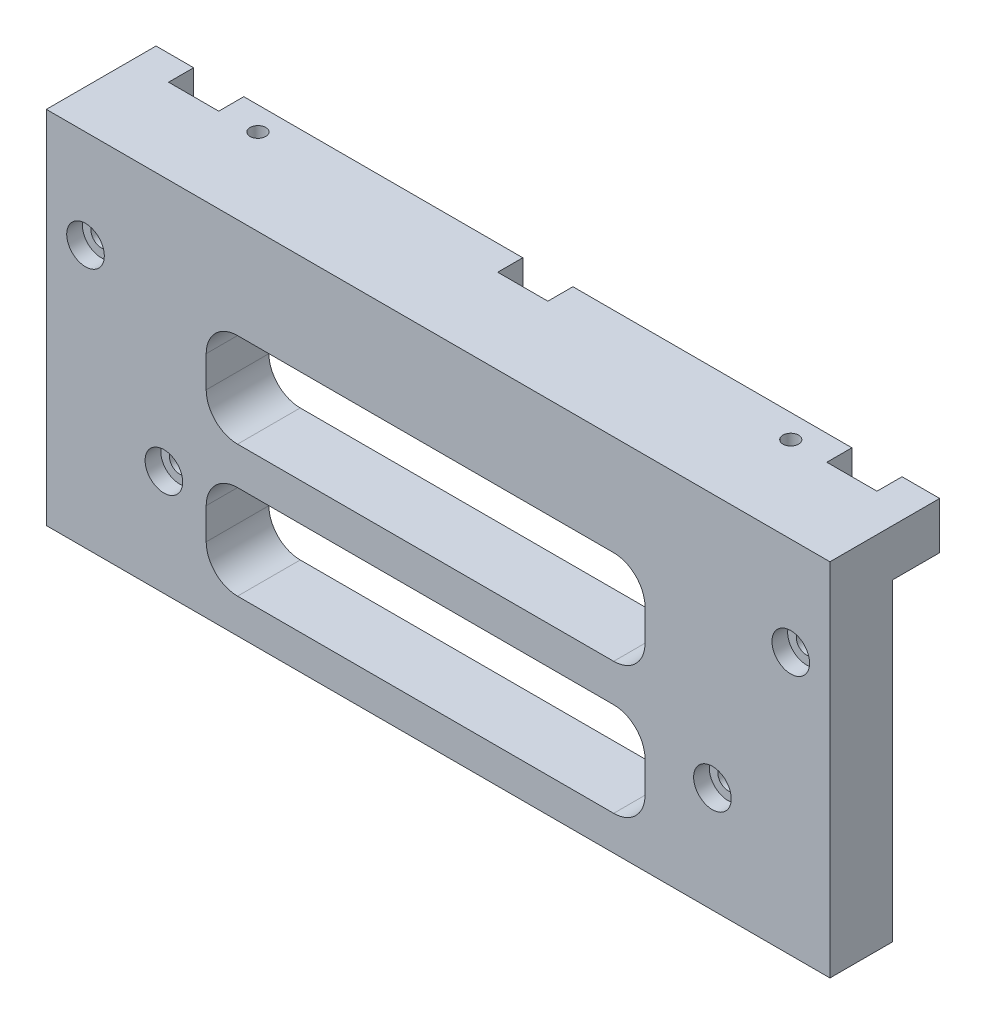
ISO-10303-21;
HEADER;
FILE_DESCRIPTION(('STEP AP214'),'2;1');
FILE_NAME('part.step','',(''),(''),'','','');
FILE_SCHEMA(('AUTOMOTIVE_DESIGN { 1 0 10303 214 1 1 1 1 }'));
ENDSEC;
DATA;
#1=APPLICATION_CONTEXT('core data for automotive mechanical design processes');
#2=APPLICATION_PROTOCOL_DEFINITION('international standard','automotive_design',2000,#1);
#3=PRODUCT_CONTEXT('',#1,'mechanical');
#4=PRODUCT('Part','Part','',(#3));
#5=PRODUCT_RELATED_PRODUCT_CATEGORY('part','',(#4));
#6=PRODUCT_DEFINITION_FORMATION('','',#4);
#7=PRODUCT_DEFINITION_CONTEXT('part definition',#1,'design');
#8=PRODUCT_DEFINITION('design','',#6,#7);
#9=PRODUCT_DEFINITION_SHAPE('','',#8);
#10=(LENGTH_UNIT() NAMED_UNIT(*) SI_UNIT(.MILLI.,.METRE.));
#11=(NAMED_UNIT(*) PLANE_ANGLE_UNIT() SI_UNIT($,.RADIAN.));
#12=(NAMED_UNIT(*) SI_UNIT($,.STERADIAN.) SOLID_ANGLE_UNIT());
#13=UNCERTAINTY_MEASURE_WITH_UNIT(LENGTH_MEASURE(1.E-05),#10,'distance_accuracy_value','');
#14=(GEOMETRIC_REPRESENTATION_CONTEXT(3) GLOBAL_UNCERTAINTY_ASSIGNED_CONTEXT((#13)) GLOBAL_UNIT_ASSIGNED_CONTEXT((#10,
#11,#12)) REPRESENTATION_CONTEXT('',''));
#15=CARTESIAN_POINT('',(0.,0.,0.));
#16=DIRECTION('',(0.,0.,1.));
#17=DIRECTION('',(1.,0.,0.));
#18=AXIS2_PLACEMENT_3D('',#15,#16,#17);
#19=CARTESIAN_POINT('',(0.,0.,-15.));
#20=DIRECTION('',(0.,0.,-1.));
#21=DIRECTION('',(-1.,0.,0.));
#22=AXIS2_PLACEMENT_3D('',#19,#20,#21);
#23=PLANE('',#22);
#24=DIRECTION('',(0.,1.,0.));
#25=VECTOR('',#24,1.);
#26=CARTESIAN_POINT('',(12.,-0.001000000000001,-15.));
#27=LINE('',#26,#25);
#28=CARTESIAN_POINT('',(12.,100.,-15.));
#29=VERTEX_POINT('',#28);
#30=CARTESIAN_POINT('',(12.,115.,-15.));
#31=VERTEX_POINT('',#30);
#32=EDGE_CURVE('E284',#29,#31,#27,.T.);
#33=ORIENTED_EDGE('',*,*,#32,.F.);
#34=DIRECTION('',(-1.,0.,0.));
#35=VECTOR('',#34,1.);
#36=CARTESIAN_POINT('',(250.,100.,-15.));
#37=LINE('',#36,#35);
#38=CARTESIAN_POINT('',(0.,100.,-15.));
#39=VERTEX_POINT('',#38);
#40=EDGE_CURVE('E290',#29,#39,#37,.T.);
#41=ORIENTED_EDGE('',*,*,#40,.T.);
#42=DIRECTION('',(0.,1.,0.));
#43=VECTOR('',#42,1.);
#44=CARTESIAN_POINT('',(0.,115.,-15.));
#45=LINE('',#44,#43);
#46=CARTESIAN_POINT('',(0.,115.,-15.));
#47=VERTEX_POINT('',#46);
#48=EDGE_CURVE('E470',#39,#47,#45,.T.);
#49=ORIENTED_EDGE('',*,*,#48,.T.);
#50=DIRECTION('',(1.,0.,0.));
#51=VECTOR('',#50,1.);
#52=CARTESIAN_POINT('',(250.,115.,-15.));
#53=LINE('',#52,#51);
#54=EDGE_CURVE('E476',#47,#31,#53,.T.);
#55=ORIENTED_EDGE('',*,*,#54,.T.);
#56=EDGE_LOOP('',(#33,#41,#49,#55));
#57=FACE_BOUND('',#56,.T.);
#58=ADVANCED_FACE('F41',(#57),#23,.T.);
#59=DIRECTION('',(0.,1.,0.));
#60=VECTOR('',#59,1.);
#61=CARTESIAN_POINT('',(28.,-0.001000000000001,-15.));
#62=LINE('',#61,#60);
#63=CARTESIAN_POINT('',(28.,100.,-15.));
#64=VERTEX_POINT('',#63);
#65=CARTESIAN_POINT('',(28.,115.,-15.));
#66=VERTEX_POINT('',#65);
#67=EDGE_CURVE('E307',#64,#66,#62,.T.);
#68=ORIENTED_EDGE('',*,*,#67,.T.);
#69=CARTESIAN_POINT('',(117.,115.,-15.));
#70=VERTEX_POINT('',#69);
#71=EDGE_CURVE('E481',#66,#70,#53,.T.);
#72=ORIENTED_EDGE('',*,*,#71,.T.);
#73=DIRECTION('',(0.,1.,0.));
#74=VECTOR('',#73,1.);
#75=CARTESIAN_POINT('',(117.,-0.001000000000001,-15.));
#76=LINE('',#75,#74);
#77=CARTESIAN_POINT('',(117.,100.,-15.));
#78=VERTEX_POINT('',#77);
#79=EDGE_CURVE('E332',#78,#70,#76,.T.);
#80=ORIENTED_EDGE('',*,*,#79,.F.);
#81=EDGE_CURVE('E838',#78,#64,#37,.T.);
#82=ORIENTED_EDGE('',*,*,#81,.T.);
#83=EDGE_LOOP('',(#68,#72,#80,#82));
#84=FACE_BOUND('',#83,.T.);
#85=ADVANCED_FACE('F773',(#84),#23,.T.);
#86=DIRECTION('',(0.,1.,0.));
#87=VECTOR('',#86,1.);
#88=CARTESIAN_POINT('',(133.,-0.001000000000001,-15.));
#89=LINE('',#88,#87);
#90=CARTESIAN_POINT('',(133.,100.,-15.));
#91=VERTEX_POINT('',#90);
#92=CARTESIAN_POINT('',(133.,115.,-15.));
#93=VERTEX_POINT('',#92);
#94=EDGE_CURVE('E335',#91,#93,#89,.T.);
#95=ORIENTED_EDGE('',*,*,#94,.T.);
#96=CARTESIAN_POINT('',(222.,115.,-15.));
#97=VERTEX_POINT('',#96);
#98=EDGE_CURVE('E806',#93,#97,#53,.T.);
#99=ORIENTED_EDGE('',*,*,#98,.T.);
#100=DIRECTION('',(0.,1.,0.));
#101=VECTOR('',#100,1.);
#102=CARTESIAN_POINT('',(222.,-0.001000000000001,-15.));
#103=LINE('',#102,#101);
#104=CARTESIAN_POINT('',(222.,100.,-15.));
#105=VERTEX_POINT('',#104);
#106=EDGE_CURVE('E364',#105,#97,#103,.T.);
#107=ORIENTED_EDGE('',*,*,#106,.F.);
#108=EDGE_CURVE('E471',#105,#91,#37,.T.);
#109=ORIENTED_EDGE('',*,*,#108,.T.);
#110=EDGE_LOOP('',(#95,#99,#107,#109));
#111=FACE_BOUND('',#110,.T.);
#112=ADVANCED_FACE('F780',(#111),#23,.T.);
#113=CARTESIAN_POINT('',(37.5,33.75,20.));
#114=DIRECTION('',(0.,0.,-1.));
#115=DIRECTION('',(-1.,0.,0.));
#116=AXIS2_PLACEMENT_3D('',#113,#114,#115);
#117=CYLINDRICAL_SURFACE('',#116,3.24999999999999);
#118=CARTESIAN_POINT('',(37.5,33.75,7.));
#119=DIRECTION('',(0.,0.,-1.));
#120=DIRECTION('',(-1.,0.,0.));
#121=AXIS2_PLACEMENT_3D('',#118,#119,#120);
#122=CIRCLE('',#121,3.24999999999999);
#123=CARTESIAN_POINT('',(34.25,33.75,7.));
#124=VERTEX_POINT('',#123);
#125=EDGE_CURVE('E461',#124,#124,#122,.F.);
#126=ORIENTED_EDGE('',*,*,#125,.F.);
#127=EDGE_LOOP('',(#126));
#128=FACE_BOUND('',#127,.T.);
#129=CARTESIAN_POINT('',(37.5,33.75,15.));
#130=DIRECTION('',(0.,0.,1.));
#131=DIRECTION('',(1.,0.,0.));
#132=AXIS2_PLACEMENT_3D('',#129,#130,#131);
#133=CIRCLE('',#132,3.24999999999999);
#134=CARTESIAN_POINT('',(40.75,33.75,15.));
#135=VERTEX_POINT('',#134);
#136=EDGE_CURVE('E435',#135,#135,#133,.F.);
#137=ORIENTED_EDGE('',*,*,#136,.F.);
#138=EDGE_LOOP('',(#137));
#139=FACE_BOUND('',#138,.T.);
#140=ADVANCED_FACE('F794',(#128,#139),#117,.F.);
#141=CARTESIAN_POINT('',(12.5,83.75,20.));
#142=DIRECTION('',(0.,0.,-1.));
#143=DIRECTION('',(-1.,0.,0.));
#144=AXIS2_PLACEMENT_3D('',#141,#142,#143);
#145=CYLINDRICAL_SURFACE('',#144,3.25);
#146=CARTESIAN_POINT('',(12.5,83.75,7.));
#147=DIRECTION('',(0.,0.,-1.));
#148=DIRECTION('',(-1.,0.,0.));
#149=AXIS2_PLACEMENT_3D('',#146,#147,#148);
#150=CIRCLE('',#149,3.25);
#151=CARTESIAN_POINT('',(9.25,83.75,7.));
#152=VERTEX_POINT('',#151);
#153=EDGE_CURVE('E602',#152,#152,#150,.F.);
#154=ORIENTED_EDGE('',*,*,#153,.F.);
#155=EDGE_LOOP('',(#154));
#156=FACE_BOUND('',#155,.T.);
#157=CARTESIAN_POINT('',(12.5,83.75,15.));
#158=DIRECTION('',(0.,0.,1.));
#159=DIRECTION('',(1.,0.,0.));
#160=AXIS2_PLACEMENT_3D('',#157,#158,#159);
#161=CIRCLE('',#160,3.25);
#162=CARTESIAN_POINT('',(15.75,83.75,15.));
#163=VERTEX_POINT('',#162);
#164=EDGE_CURVE('E616',#163,#163,#161,.F.);
#165=ORIENTED_EDGE('',*,*,#164,.F.);
#166=EDGE_LOOP('',(#165));
#167=FACE_BOUND('',#166,.T.);
#168=ADVANCED_FACE('F799',(#156,#167),#145,.F.);
#169=CARTESIAN_POINT('',(212.5,33.75,20.));
#170=DIRECTION('',(0.,0.,-1.));
#171=DIRECTION('',(-1.,0.,0.));
#172=AXIS2_PLACEMENT_3D('',#169,#170,#171);
#173=CYLINDRICAL_SURFACE('',#172,3.25000000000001);
#174=CARTESIAN_POINT('',(212.5,33.75,7.));
#175=DIRECTION('',(0.,0.,-1.));
#176=DIRECTION('',(-1.,0.,0.));
#177=AXIS2_PLACEMENT_3D('',#174,#175,#176);
#178=CIRCLE('',#177,3.25000000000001);
#179=CARTESIAN_POINT('',(209.25,33.75,7.));
#180=VERTEX_POINT('',#179);
#181=EDGE_CURVE('E598',#180,#180,#178,.F.);
#182=ORIENTED_EDGE('',*,*,#181,.F.);
#183=EDGE_LOOP('',(#182));
#184=FACE_BOUND('',#183,.T.);
#185=CARTESIAN_POINT('',(212.5,33.75,15.));
#186=DIRECTION('',(0.,0.,1.));
#187=DIRECTION('',(1.,0.,0.));
#188=AXIS2_PLACEMENT_3D('',#185,#186,#187);
#189=CIRCLE('',#188,3.25000000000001);
#190=CARTESIAN_POINT('',(215.75,33.75,15.));
#191=VERTEX_POINT('',#190);
#192=EDGE_CURVE('E612',#191,#191,#189,.F.);
#193=ORIENTED_EDGE('',*,*,#192,.F.);
#194=EDGE_LOOP('',(#193));
#195=FACE_BOUND('',#194,.T.);
#196=ADVANCED_FACE('F944',(#184,#195),#173,.F.);
#197=CARTESIAN_POINT('',(237.5,83.75,20.));
#198=DIRECTION('',(0.,0.,-1.));
#199=DIRECTION('',(-1.,0.,0.));
#200=AXIS2_PLACEMENT_3D('',#197,#198,#199);
#201=CYLINDRICAL_SURFACE('',#200,3.25000000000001);
#202=CARTESIAN_POINT('',(237.5,83.75,7.));
#203=DIRECTION('',(0.,0.,-1.));
#204=DIRECTION('',(-1.,0.,0.));
#205=AXIS2_PLACEMENT_3D('',#202,#203,#204);
#206=CIRCLE('',#205,3.25000000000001);
#207=CARTESIAN_POINT('',(234.25,83.75,7.));
#208=VERTEX_POINT('',#207);
#209=EDGE_CURVE('E440',#208,#208,#206,.F.);
#210=ORIENTED_EDGE('',*,*,#209,.F.);
#211=EDGE_LOOP('',(#210));
#212=FACE_BOUND('',#211,.T.);
#213=CARTESIAN_POINT('',(237.5,83.75,15.));
#214=DIRECTION('',(0.,0.,1.));
#215=DIRECTION('',(1.,0.,0.));
#216=AXIS2_PLACEMENT_3D('',#213,#214,#215);
#217=CIRCLE('',#216,3.25000000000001);
#218=CARTESIAN_POINT('',(240.75,83.75,15.));
#219=VERTEX_POINT('',#218);
#220=EDGE_CURVE('E406',#219,#219,#217,.F.);
#221=ORIENTED_EDGE('',*,*,#220,.F.);
#222=EDGE_LOOP('',(#221));
#223=FACE_BOUND('',#222,.T.);
#224=ADVANCED_FACE('F948',(#212,#223),#201,.F.);
#225=CARTESIAN_POINT('',(0.,0.,20.));
#226=DIRECTION('',(1.,0.,0.));
#227=DIRECTION('',(0.,0.,-1.));
#228=AXIS2_PLACEMENT_3D('',#225,#226,#227);
#229=PLANE('',#228);
#230=DIRECTION('',(0.,0.,-1.));
#231=VECTOR('',#230,1.);
#232=CARTESIAN_POINT('',(0.,115.,20.));
#233=LINE('',#232,#231);
#234=CARTESIAN_POINT('',(0.,115.,20.));
#235=VERTEX_POINT('',#234);
#236=EDGE_CURVE('E571',#235,#47,#233,.T.);
#237=ORIENTED_EDGE('',*,*,#236,.T.);
#238=ORIENTED_EDGE('',*,*,#48,.F.);
#239=DIRECTION('',(0.,0.,1.));
#240=VECTOR('',#239,1.);
#241=CARTESIAN_POINT('',(0.,100.,-15.));
#242=LINE('',#241,#240);
#243=CARTESIAN_POINT('',(0.,100.,0.));
#244=VERTEX_POINT('',#243);
#245=EDGE_CURVE('E480',#39,#244,#242,.T.);
#246=ORIENTED_EDGE('',*,*,#245,.T.);
#247=DIRECTION('',(0.,-1.,0.));
#248=VECTOR('',#247,1.);
#249=CARTESIAN_POINT('',(0.,0.,0.));
#250=LINE('',#249,#248);
#251=CARTESIAN_POINT('',(0.,0.,0.));
#252=VERTEX_POINT('',#251);
#253=EDGE_CURVE('E510',#244,#252,#250,.T.);
#254=ORIENTED_EDGE('',*,*,#253,.T.);
#255=DIRECTION('',(0.,0.,-1.));
#256=VECTOR('',#255,1.);
#257=CARTESIAN_POINT('',(0.,0.,20.));
#258=LINE('',#257,#256);
#259=CARTESIAN_POINT('',(0.,0.,20.));
#260=VERTEX_POINT('',#259);
#261=EDGE_CURVE('E590',#260,#252,#258,.T.);
#262=ORIENTED_EDGE('',*,*,#261,.F.);
#263=DIRECTION('',(0.,-1.,0.));
#264=VECTOR('',#263,1.);
#265=CARTESIAN_POINT('',(0.,0.,20.));
#266=LINE('',#265,#264);
#267=EDGE_CURVE('E557',#235,#260,#266,.T.);
#268=ORIENTED_EDGE('',*,*,#267,.F.);
#269=EDGE_LOOP('',(#237,#238,#246,#254,#262,#268));
#270=FACE_BOUND('',#269,.T.);
#271=ADVANCED_FACE('F847',(#270),#229,.F.);
#272=CARTESIAN_POINT('',(0.,0.,20.));
#273=DIRECTION('',(0.,1.,0.));
#274=DIRECTION('',(0.,0.,1.));
#275=AXIS2_PLACEMENT_3D('',#272,#273,#274);
#276=PLANE('',#275);
#277=DIRECTION('',(1.,0.,0.));
#278=VECTOR('',#277,1.);
#279=CARTESIAN_POINT('',(0.,0.,0.));
#280=LINE('',#279,#278);
#281=CARTESIAN_POINT('',(250.,0.,0.));
#282=VERTEX_POINT('',#281);
#283=EDGE_CURVE('E574',#252,#282,#280,.T.);
#284=ORIENTED_EDGE('',*,*,#283,.T.);
#285=DIRECTION('',(0.,0.,-1.));
#286=VECTOR('',#285,1.);
#287=CARTESIAN_POINT('',(250.,0.,20.));
#288=LINE('',#287,#286);
#289=CARTESIAN_POINT('',(250.,0.,20.));
#290=VERTEX_POINT('',#289);
#291=EDGE_CURVE('E586',#290,#282,#288,.T.);
#292=ORIENTED_EDGE('',*,*,#291,.F.);
#293=DIRECTION('',(1.,0.,0.));
#294=VECTOR('',#293,1.);
#295=CARTESIAN_POINT('',(0.,0.,20.));
#296=LINE('',#295,#294);
#297=EDGE_CURVE('E561',#260,#290,#296,.T.);
#298=ORIENTED_EDGE('',*,*,#297,.F.);
#299=ORIENTED_EDGE('',*,*,#261,.T.);
#300=EDGE_LOOP('',(#284,#292,#298,#299));
#301=FACE_BOUND('',#300,.T.);
#302=ADVANCED_FACE('F974',(#301),#276,.F.);
#303=CARTESIAN_POINT('',(250.,0.,20.));
#304=DIRECTION('',(-1.,0.,0.));
#305=DIRECTION('',(0.,0.,1.));
#306=AXIS2_PLACEMENT_3D('',#303,#304,#305);
#307=PLANE('',#306);
#308=DIRECTION('',(0.,1.,0.));
#309=VECTOR('',#308,1.);
#310=CARTESIAN_POINT('',(250.,0.,0.));
#311=LINE('',#310,#309);
#312=CARTESIAN_POINT('',(250.,100.,0.));
#313=VERTEX_POINT('',#312);
#314=EDGE_CURVE('E562',#282,#313,#311,.T.);
#315=ORIENTED_EDGE('',*,*,#314,.T.);
#316=DIRECTION('',(0.,0.,1.));
#317=VECTOR('',#316,1.);
#318=CARTESIAN_POINT('',(250.,100.,-15.));
#319=LINE('',#318,#317);
#320=CARTESIAN_POINT('',(250.,100.,-15.));
#321=VERTEX_POINT('',#320);
#322=EDGE_CURVE('E488',#321,#313,#319,.T.);
#323=ORIENTED_EDGE('',*,*,#322,.F.);
#324=DIRECTION('',(0.,-1.,0.));
#325=VECTOR('',#324,1.);
#326=CARTESIAN_POINT('',(250.,115.,-15.));
#327=LINE('',#326,#325);
#328=CARTESIAN_POINT('',(250.,115.,-15.));
#329=VERTEX_POINT('',#328);
#330=EDGE_CURVE('E462',#329,#321,#327,.T.);
#331=ORIENTED_EDGE('',*,*,#330,.F.);
#332=DIRECTION('',(0.,0.,-1.));
#333=VECTOR('',#332,1.);
#334=CARTESIAN_POINT('',(250.,115.,20.));
#335=LINE('',#334,#333);
#336=CARTESIAN_POINT('',(250.,115.,20.));
#337=VERTEX_POINT('',#336);
#338=EDGE_CURVE('E582',#337,#329,#335,.T.);
#339=ORIENTED_EDGE('',*,*,#338,.F.);
#340=DIRECTION('',(0.,1.,0.));
#341=VECTOR('',#340,1.);
#342=CARTESIAN_POINT('',(250.,0.,20.));
#343=LINE('',#342,#341);
#344=EDGE_CURVE('E565',#290,#337,#343,.T.);
#345=ORIENTED_EDGE('',*,*,#344,.F.);
#346=ORIENTED_EDGE('',*,*,#291,.T.);
#347=EDGE_LOOP('',(#315,#323,#331,#339,#345,#346));
#348=FACE_BOUND('',#347,.T.);
#349=ADVANCED_FACE('F826',(#348),#307,.F.);
#350=CARTESIAN_POINT('',(0.,115.,20.));
#351=DIRECTION('',(0.,-1.,0.));
#352=DIRECTION('',(0.,0.,-1.));
#353=AXIS2_PLACEMENT_3D('',#350,#351,#352);
#354=PLANE('',#353);
#355=CARTESIAN_POINT('',(40.,115.,-7.5));
#356=DIRECTION('',(0.,-1.,0.));
#357=DIRECTION('',(0.,0.,-1.));
#358=AXIS2_PLACEMENT_3D('',#355,#356,#357);
#359=CIRCLE('',#358,2.49999999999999);
#360=CARTESIAN_POINT('',(40.,115.,-9.99999999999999));
#361=VERTEX_POINT('',#360);
#362=EDGE_CURVE('E444',#361,#361,#359,.T.);
#363=ORIENTED_EDGE('',*,*,#362,.T.);
#364=EDGE_LOOP('',(#363));
#365=FACE_BOUND('',#364,.T.);
#366=CARTESIAN_POINT('',(210.,115.,-7.5));
#367=DIRECTION('',(0.,-1.,0.));
#368=DIRECTION('',(0.,0.,-1.));
#369=AXIS2_PLACEMENT_3D('',#366,#367,#368);
#370=CIRCLE('',#369,2.5);
#371=CARTESIAN_POINT('',(210.,115.,-9.99999999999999));
#372=VERTEX_POINT('',#371);
#373=EDGE_CURVE('E453',#372,#372,#370,.T.);
#374=ORIENTED_EDGE('',*,*,#373,.T.);
#375=EDGE_LOOP('',(#374));
#376=FACE_BOUND('',#375,.T.);
#377=DIRECTION('',(1.,0.,0.));
#378=VECTOR('',#377,1.);
#379=CARTESIAN_POINT('',(12.,115.,-7.));
#380=LINE('',#379,#378);
#381=CARTESIAN_POINT('',(12.,115.,-7.));
#382=VERTEX_POINT('',#381);
#383=CARTESIAN_POINT('',(28.,115.,-7.));
#384=VERTEX_POINT('',#383);
#385=EDGE_CURVE('E296',#382,#384,#380,.T.);
#386=ORIENTED_EDGE('',*,*,#385,.F.);
#387=DIRECTION('',(0.,0.,1.));
#388=VECTOR('',#387,1.);
#389=CARTESIAN_POINT('',(12.,115.,-15.));
#390=LINE('',#389,#388);
#391=EDGE_CURVE('E268',#31,#382,#390,.T.);
#392=ORIENTED_EDGE('',*,*,#391,.F.);
#393=ORIENTED_EDGE('',*,*,#54,.F.);
#394=ORIENTED_EDGE('',*,*,#236,.F.);
#395=DIRECTION('',(-1.,0.,0.));
#396=VECTOR('',#395,1.);
#397=CARTESIAN_POINT('',(0.,115.,20.));
#398=LINE('',#397,#396);
#399=EDGE_CURVE('E568',#337,#235,#398,.T.);
#400=ORIENTED_EDGE('',*,*,#399,.F.);
#401=ORIENTED_EDGE('',*,*,#338,.T.);
#402=CARTESIAN_POINT('',(238.,115.,-15.));
#403=VERTEX_POINT('',#402);
#404=EDGE_CURVE('E475',#403,#329,#53,.T.);
#405=ORIENTED_EDGE('',*,*,#404,.F.);
#406=DIRECTION('',(0.,0.,-1.));
#407=VECTOR('',#406,1.);
#408=CARTESIAN_POINT('',(238.,115.,-15.));
#409=LINE('',#408,#407);
#410=CARTESIAN_POINT('',(238.,115.,-7.));
#411=VERTEX_POINT('',#410);
#412=EDGE_CURVE('E57',#411,#403,#409,.T.);
#413=ORIENTED_EDGE('',*,*,#412,.F.);
#414=DIRECTION('',(1.,0.,0.));
#415=VECTOR('',#414,1.);
#416=CARTESIAN_POINT('',(222.,115.,-7.));
#417=LINE('',#416,#415);
#418=CARTESIAN_POINT('',(222.,115.,-7.));
#419=VERTEX_POINT('',#418);
#420=EDGE_CURVE('E357',#419,#411,#417,.T.);
#421=ORIENTED_EDGE('',*,*,#420,.F.);
#422=DIRECTION('',(0.,0.,1.));
#423=VECTOR('',#422,1.);
#424=CARTESIAN_POINT('',(222.,115.,-15.));
#425=LINE('',#424,#423);
#426=EDGE_CURVE('E353',#97,#419,#425,.T.);
#427=ORIENTED_EDGE('',*,*,#426,.F.);
#428=ORIENTED_EDGE('',*,*,#98,.F.);
#429=DIRECTION('',(0.,0.,-1.));
#430=VECTOR('',#429,1.);
#431=CARTESIAN_POINT('',(133.,115.,-15.));
#432=LINE('',#431,#430);
#433=CARTESIAN_POINT('',(133.,115.,-7.));
#434=VERTEX_POINT('',#433);
#435=EDGE_CURVE('E65',#434,#93,#432,.T.);
#436=ORIENTED_EDGE('',*,*,#435,.F.);
#437=DIRECTION('',(1.,0.,0.));
#438=VECTOR('',#437,1.);
#439=CARTESIAN_POINT('',(117.,115.,-7.));
#440=LINE('',#439,#438);
#441=CARTESIAN_POINT('',(117.,115.,-7.));
#442=VERTEX_POINT('',#441);
#443=EDGE_CURVE('E325',#442,#434,#440,.T.);
#444=ORIENTED_EDGE('',*,*,#443,.F.);
#445=DIRECTION('',(0.,0.,1.));
#446=VECTOR('',#445,1.);
#447=CARTESIAN_POINT('',(117.,115.,-15.));
#448=LINE('',#447,#446);
#449=EDGE_CURVE('E321',#70,#442,#448,.T.);
#450=ORIENTED_EDGE('',*,*,#449,.F.);
#451=ORIENTED_EDGE('',*,*,#71,.F.);
#452=DIRECTION('',(0.,0.,-1.));
#453=VECTOR('',#452,1.);
#454=CARTESIAN_POINT('',(28.,115.,-15.));
#455=LINE('',#454,#453);
#456=EDGE_CURVE('E274',#384,#66,#455,.T.);
#457=ORIENTED_EDGE('',*,*,#456,.F.);
#458=EDGE_LOOP('',(#386,#392,#393,#394,#400,#401,#405,#413,#421,#427,#428,#436,#444,#450,#451,#457));
#459=FACE_BOUND('',#458,.T.);
#460=ADVANCED_FACE('F811',(#365,#376,#459),#354,.F.);
#461=CARTESIAN_POINT('',(0.,0.,20.));
#462=DIRECTION('',(0.,0.,-1.));
#463=DIRECTION('',(-1.,0.,0.));
#464=AXIS2_PLACEMENT_3D('',#461,#462,#463);
#465=PLANE('',#464);
#466=CARTESIAN_POINT('',(212.5,33.75,20.));
#467=DIRECTION('',(0.,0.,1.));
#468=DIRECTION('',(1.,0.,0.));
#469=AXIS2_PLACEMENT_3D('',#466,#467,#468);
#470=CIRCLE('',#469,6.00000000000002);
#471=CARTESIAN_POINT('',(218.5,33.75,20.));
#472=VERTEX_POINT('',#471);
#473=EDGE_CURVE('E283',#472,#472,#470,.T.);
#474=ORIENTED_EDGE('',*,*,#473,.F.);
#475=EDGE_LOOP('',(#474));
#476=FACE_BOUND('',#475,.T.);
#477=CARTESIAN_POINT('',(237.5,83.75,20.));
#478=DIRECTION('',(0.,0.,1.));
#479=DIRECTION('',(1.,0.,0.));
#480=AXIS2_PLACEMENT_3D('',#477,#478,#479);
#481=CIRCLE('',#480,6.00000000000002);
#482=CARTESIAN_POINT('',(243.5,83.75,20.));
#483=VERTEX_POINT('',#482);
#484=EDGE_CURVE('E391',#483,#483,#481,.T.);
#485=ORIENTED_EDGE('',*,*,#484,.F.);
#486=EDGE_LOOP('',(#485));
#487=FACE_BOUND('',#486,.T.);
#488=CARTESIAN_POINT('',(12.5,83.75,20.));
#489=DIRECTION('',(0.,0.,1.));
#490=DIRECTION('',(1.,0.,0.));
#491=AXIS2_PLACEMENT_3D('',#488,#489,#490);
#492=CIRCLE('',#491,6.);
#493=CARTESIAN_POINT('',(18.5,83.75,20.));
#494=VERTEX_POINT('',#493);
#495=EDGE_CURVE('E383',#494,#494,#492,.T.);
#496=ORIENTED_EDGE('',*,*,#495,.F.);
#497=EDGE_LOOP('',(#496));
#498=FACE_BOUND('',#497,.T.);
#499=CARTESIAN_POINT('',(37.5,33.75,20.));
#500=DIRECTION('',(0.,0.,1.));
#501=DIRECTION('',(1.,0.,0.));
#502=AXIS2_PLACEMENT_3D('',#499,#500,#501);
#503=CIRCLE('',#502,5.99999999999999);
#504=CARTESIAN_POINT('',(43.5,33.75,20.));
#505=VERTEX_POINT('',#504);
#506=EDGE_CURVE('E382',#505,#505,#503,.T.);
#507=ORIENTED_EDGE('',*,*,#506,.F.);
#508=EDGE_LOOP('',(#507));
#509=FACE_BOUND('',#508,.T.);
#510=DIRECTION('',(1.,0.,0.));
#511=VECTOR('',#510,1.);
#512=CARTESIAN_POINT('',(51.,53.,20.));
#513=LINE('',#512,#511);
#514=CARTESIAN_POINT('',(61.,53.,20.));
#515=VERTEX_POINT('',#514);
#516=CARTESIAN_POINT('',(181.,53.,20.));
#517=VERTEX_POINT('',#516);
#518=EDGE_CURVE('E515',#515,#517,#513,.T.);
#519=ORIENTED_EDGE('',*,*,#518,.F.);
#520=CARTESIAN_POINT('',(61.,63.,20.));
#521=DIRECTION('',(0.,0.,-1.));
#522=DIRECTION('',(-1.,0.,0.));
#523=AXIS2_PLACEMENT_3D('',#520,#521,#522);
#524=CIRCLE('',#523,10.);
#525=CARTESIAN_POINT('',(51.,63.,20.));
#526=VERTEX_POINT('',#525);
#527=EDGE_CURVE('E678',#515,#526,#524,.T.);
#528=ORIENTED_EDGE('',*,*,#527,.T.);
#529=DIRECTION('',(0.,-1.,0.));
#530=VECTOR('',#529,1.);
#531=CARTESIAN_POINT('',(51.,83.,20.));
#532=LINE('',#531,#530);
#533=CARTESIAN_POINT('',(51.,73.,20.));
#534=VERTEX_POINT('',#533);
#535=EDGE_CURVE('E511',#534,#526,#532,.T.);
#536=ORIENTED_EDGE('',*,*,#535,.F.);
#537=CARTESIAN_POINT('',(61.,73.,20.));
#538=DIRECTION('',(0.,0.,-1.));
#539=DIRECTION('',(-1.,0.,0.));
#540=AXIS2_PLACEMENT_3D('',#537,#538,#539);
#541=CIRCLE('',#540,10.);
#542=CARTESIAN_POINT('',(61.,83.,20.));
#543=VERTEX_POINT('',#542);
#544=EDGE_CURVE('E50',#534,#543,#541,.T.);
#545=ORIENTED_EDGE('',*,*,#544,.T.);
#546=DIRECTION('',(-1.,0.,0.));
#547=VECTOR('',#546,1.);
#548=CARTESIAN_POINT('',(51.,83.,20.));
#549=LINE('',#548,#547);
#550=CARTESIAN_POINT('',(181.,83.,20.));
#551=VERTEX_POINT('',#550);
#552=EDGE_CURVE('E498',#551,#543,#549,.T.);
#553=ORIENTED_EDGE('',*,*,#552,.F.);
#554=CARTESIAN_POINT('',(181.,73.,20.));
#555=DIRECTION('',(0.,0.,-1.));
#556=DIRECTION('',(-1.,0.,0.));
#557=AXIS2_PLACEMENT_3D('',#554,#555,#556);
#558=CIRCLE('',#557,10.);
#559=CARTESIAN_POINT('',(191.,73.,20.));
#560=VERTEX_POINT('',#559);
#561=EDGE_CURVE('E708',#551,#560,#558,.T.);
#562=ORIENTED_EDGE('',*,*,#561,.T.);
#563=DIRECTION('',(0.,1.,0.));
#564=VECTOR('',#563,1.);
#565=CARTESIAN_POINT('',(191.,83.,20.));
#566=LINE('',#565,#564);
#567=CARTESIAN_POINT('',(191.,63.,20.));
#568=VERTEX_POINT('',#567);
#569=EDGE_CURVE('E520',#568,#560,#566,.T.);
#570=ORIENTED_EDGE('',*,*,#569,.F.);
#571=CARTESIAN_POINT('',(181.,63.,20.));
#572=DIRECTION('',(0.,0.,-1.));
#573=DIRECTION('',(-1.,0.,0.));
#574=AXIS2_PLACEMENT_3D('',#571,#572,#573);
#575=CIRCLE('',#574,10.);
#576=EDGE_CURVE('E696',#568,#517,#575,.T.);
#577=ORIENTED_EDGE('',*,*,#576,.T.);
#578=EDGE_LOOP('',(#519,#528,#536,#545,#553,#562,#570,#577));
#579=FACE_BOUND('',#578,.T.);
#580=DIRECTION('',(1.,0.,0.));
#581=VECTOR('',#580,1.);
#582=CARTESIAN_POINT('',(51.,11.,20.));
#583=LINE('',#582,#581);
#584=CARTESIAN_POINT('',(61.,11.,20.));
#585=VERTEX_POINT('',#584);
#586=CARTESIAN_POINT('',(181.,11.,20.));
#587=VERTEX_POINT('',#586);
#588=EDGE_CURVE('E546',#585,#587,#583,.T.);
#589=ORIENTED_EDGE('',*,*,#588,.F.);
#590=CARTESIAN_POINT('',(61.,21.,20.));
#591=DIRECTION('',(0.,0.,-1.));
#592=DIRECTION('',(-1.,0.,0.));
#593=AXIS2_PLACEMENT_3D('',#590,#591,#592);
#594=CIRCLE('',#593,10.);
#595=CARTESIAN_POINT('',(51.,21.,20.));
#596=VERTEX_POINT('',#595);
#597=EDGE_CURVE('E684',#585,#596,#594,.T.);
#598=ORIENTED_EDGE('',*,*,#597,.T.);
#599=DIRECTION('',(0.,-1.,0.));
#600=VECTOR('',#599,1.);
#601=CARTESIAN_POINT('',(51.,41.,20.));
#602=LINE('',#601,#600);
#603=CARTESIAN_POINT('',(51.,31.,20.));
#604=VERTEX_POINT('',#603);
#605=EDGE_CURVE('E492',#604,#596,#602,.T.);
#606=ORIENTED_EDGE('',*,*,#605,.F.);
#607=CARTESIAN_POINT('',(61.,31.,20.));
#608=DIRECTION('',(0.,0.,-1.));
#609=DIRECTION('',(-1.,0.,0.));
#610=AXIS2_PLACEMENT_3D('',#607,#608,#609);
#611=CIRCLE('',#610,10.);
#612=CARTESIAN_POINT('',(61.,41.,20.));
#613=VERTEX_POINT('',#612);
#614=EDGE_CURVE('E714',#604,#613,#611,.T.);
#615=ORIENTED_EDGE('',*,*,#614,.T.);
#616=DIRECTION('',(-1.,0.,0.));
#617=VECTOR('',#616,1.);
#618=CARTESIAN_POINT('',(51.,41.,20.));
#619=LINE('',#618,#617);
#620=CARTESIAN_POINT('',(181.,41.,20.));
#621=VERTEX_POINT('',#620);
#622=EDGE_CURVE('E532',#621,#613,#619,.T.);
#623=ORIENTED_EDGE('',*,*,#622,.F.);
#624=CARTESIAN_POINT('',(181.,31.,20.));
#625=DIRECTION('',(0.,0.,-1.));
#626=DIRECTION('',(-1.,0.,0.));
#627=AXIS2_PLACEMENT_3D('',#624,#625,#626);
#628=CIRCLE('',#627,10.);
#629=CARTESIAN_POINT('',(191.,31.,20.));
#630=VERTEX_POINT('',#629);
#631=EDGE_CURVE('E702',#621,#630,#628,.T.);
#632=ORIENTED_EDGE('',*,*,#631,.T.);
#633=DIRECTION('',(0.,1.,0.));
#634=VECTOR('',#633,1.);
#635=CARTESIAN_POINT('',(191.,41.,20.));
#636=LINE('',#635,#634);
#637=CARTESIAN_POINT('',(191.,21.,20.));
#638=VERTEX_POINT('',#637);
#639=EDGE_CURVE('E550',#638,#630,#636,.T.);
#640=ORIENTED_EDGE('',*,*,#639,.F.);
#641=CARTESIAN_POINT('',(181.,21.,20.));
#642=DIRECTION('',(0.,0.,-1.));
#643=DIRECTION('',(-1.,0.,0.));
#644=AXIS2_PLACEMENT_3D('',#641,#642,#643);
#645=CIRCLE('',#644,10.);
#646=EDGE_CURVE('E690',#638,#587,#645,.T.);
#647=ORIENTED_EDGE('',*,*,#646,.T.);
#648=EDGE_LOOP('',(#589,#598,#606,#615,#623,#632,#640,#647));
#649=FACE_BOUND('',#648,.T.);
#650=ORIENTED_EDGE('',*,*,#267,.T.);
#651=ORIENTED_EDGE('',*,*,#297,.T.);
#652=ORIENTED_EDGE('',*,*,#344,.T.);
#653=ORIENTED_EDGE('',*,*,#399,.T.);
#654=EDGE_LOOP('',(#650,#651,#652,#653));
#655=FACE_BOUND('',#654,.T.);
#656=ADVANCED_FACE('F724',(#476,#487,#498,#509,#579,#649,#655),#465,.F.);
#657=CARTESIAN_POINT('',(0.,0.,0.));
#658=DIRECTION('',(0.,0.,-1.));
#659=DIRECTION('',(-1.,0.,0.));
#660=AXIS2_PLACEMENT_3D('',#657,#658,#659);
#661=PLANE('',#660);
#662=CARTESIAN_POINT('',(237.5,83.75,0.));
#663=DIRECTION('',(0.,0.,-1.));
#664=DIRECTION('',(-1.,0.,0.));
#665=AXIS2_PLACEMENT_3D('',#662,#663,#664);
#666=CIRCLE('',#665,6.00000000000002);
#667=CARTESIAN_POINT('',(231.5,83.75,0.));
#668=VERTEX_POINT('',#667);
#669=EDGE_CURVE('E431',#668,#668,#666,.T.);
#670=ORIENTED_EDGE('',*,*,#669,.F.);
#671=EDGE_LOOP('',(#670));
#672=FACE_BOUND('',#671,.T.);
#673=CARTESIAN_POINT('',(212.5,33.75,0.));
#674=DIRECTION('',(0.,0.,-1.));
#675=DIRECTION('',(-1.,0.,0.));
#676=AXIS2_PLACEMENT_3D('',#673,#674,#675);
#677=CIRCLE('',#676,6.00000000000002);
#678=CARTESIAN_POINT('',(206.5,33.75,0.));
#679=VERTEX_POINT('',#678);
#680=EDGE_CURVE('E423',#679,#679,#677,.T.);
#681=ORIENTED_EDGE('',*,*,#680,.F.);
#682=EDGE_LOOP('',(#681));
#683=FACE_BOUND('',#682,.T.);
#684=CARTESIAN_POINT('',(12.5,83.75,0.));
#685=DIRECTION('',(0.,0.,-1.));
#686=DIRECTION('',(-1.,0.,0.));
#687=AXIS2_PLACEMENT_3D('',#684,#685,#686);
#688=CIRCLE('',#687,6.);
#689=CARTESIAN_POINT('',(6.5,83.75,0.));
#690=VERTEX_POINT('',#689);
#691=EDGE_CURVE('E415',#690,#690,#688,.T.);
#692=ORIENTED_EDGE('',*,*,#691,.F.);
#693=EDGE_LOOP('',(#692));
#694=FACE_BOUND('',#693,.T.);
#695=CARTESIAN_POINT('',(37.5,33.75,0.));
#696=DIRECTION('',(0.,0.,-1.));
#697=DIRECTION('',(-1.,0.,0.));
#698=AXIS2_PLACEMENT_3D('',#695,#696,#697);
#699=CIRCLE('',#698,5.99999999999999);
#700=CARTESIAN_POINT('',(31.5,33.75,0.));
#701=VERTEX_POINT('',#700);
#702=EDGE_CURVE('E414',#701,#701,#699,.T.);
#703=ORIENTED_EDGE('',*,*,#702,.F.);
#704=EDGE_LOOP('',(#703));
#705=FACE_BOUND('',#704,.T.);
#706=DIRECTION('',(-1.,0.,0.));
#707=VECTOR('',#706,1.);
#708=CARTESIAN_POINT('',(250.,100.,0.));
#709=LINE('',#708,#707);
#710=EDGE_CURVE('E448',#313,#244,#709,.T.);
#711=ORIENTED_EDGE('',*,*,#710,.F.);
#712=ORIENTED_EDGE('',*,*,#314,.F.);
#713=ORIENTED_EDGE('',*,*,#283,.F.);
#714=ORIENTED_EDGE('',*,*,#253,.F.);
#715=EDGE_LOOP('',(#711,#712,#713,#714));
#716=FACE_BOUND('',#715,.T.);
#717=DIRECTION('',(-1.,0.,0.));
#718=VECTOR('',#717,1.);
#719=CARTESIAN_POINT('',(51.,83.,0.));
#720=LINE('',#719,#718);
#721=CARTESIAN_POINT('',(181.,83.,0.));
#722=VERTEX_POINT('',#721);
#723=CARTESIAN_POINT('',(61.,83.,0.));
#724=VERTEX_POINT('',#723);
#725=EDGE_CURVE('E506',#722,#724,#720,.T.);
#726=ORIENTED_EDGE('',*,*,#725,.T.);
#727=CARTESIAN_POINT('',(61.,73.,0.));
#728=DIRECTION('',(0.,0.,-1.));
#729=DIRECTION('',(-1.,0.,0.));
#730=AXIS2_PLACEMENT_3D('',#727,#728,#729);
#731=CIRCLE('',#730,10.);
#732=CARTESIAN_POINT('',(51.,73.,0.));
#733=VERTEX_POINT('',#732);
#734=EDGE_CURVE('E11',#724,#733,#731,.F.);
#735=ORIENTED_EDGE('',*,*,#734,.T.);
#736=DIRECTION('',(0.,-1.,0.));
#737=VECTOR('',#736,1.);
#738=CARTESIAN_POINT('',(51.,83.,0.));
#739=LINE('',#738,#737);
#740=CARTESIAN_POINT('',(51.,63.,0.));
#741=VERTEX_POINT('',#740);
#742=EDGE_CURVE('E493',#733,#741,#739,.T.);
#743=ORIENTED_EDGE('',*,*,#742,.T.);
#744=CARTESIAN_POINT('',(61.,63.,0.));
#745=DIRECTION('',(0.,0.,-1.));
#746=DIRECTION('',(-1.,0.,0.));
#747=AXIS2_PLACEMENT_3D('',#744,#745,#746);
#748=CIRCLE('',#747,10.);
#749=CARTESIAN_POINT('',(61.,53.,0.));
#750=VERTEX_POINT('',#749);
#751=EDGE_CURVE('E681',#741,#750,#748,.F.);
#752=ORIENTED_EDGE('',*,*,#751,.T.);
#753=DIRECTION('',(1.,0.,0.));
#754=VECTOR('',#753,1.);
#755=CARTESIAN_POINT('',(51.,53.,0.));
#756=LINE('',#755,#754);
#757=CARTESIAN_POINT('',(181.,53.,0.));
#758=VERTEX_POINT('',#757);
#759=EDGE_CURVE('E497',#750,#758,#756,.T.);
#760=ORIENTED_EDGE('',*,*,#759,.T.);
#761=CARTESIAN_POINT('',(181.,63.,0.));
#762=DIRECTION('',(0.,0.,-1.));
#763=DIRECTION('',(-1.,0.,0.));
#764=AXIS2_PLACEMENT_3D('',#761,#762,#763);
#765=CIRCLE('',#764,10.);
#766=CARTESIAN_POINT('',(191.,63.,0.));
#767=VERTEX_POINT('',#766);
#768=EDGE_CURVE('E699',#758,#767,#765,.F.);
#769=ORIENTED_EDGE('',*,*,#768,.T.);
#770=DIRECTION('',(0.,1.,0.));
#771=VECTOR('',#770,1.);
#772=CARTESIAN_POINT('',(191.,83.,0.));
#773=LINE('',#772,#771);
#774=CARTESIAN_POINT('',(191.,73.,0.));
#775=VERTEX_POINT('',#774);
#776=EDGE_CURVE('E502',#767,#775,#773,.T.);
#777=ORIENTED_EDGE('',*,*,#776,.T.);
#778=CARTESIAN_POINT('',(181.,73.,0.));
#779=DIRECTION('',(0.,0.,-1.));
#780=DIRECTION('',(-1.,0.,0.));
#781=AXIS2_PLACEMENT_3D('',#778,#779,#780);
#782=CIRCLE('',#781,10.);
#783=EDGE_CURVE('E711',#775,#722,#782,.F.);
#784=ORIENTED_EDGE('',*,*,#783,.T.);
#785=EDGE_LOOP('',(#726,#735,#743,#752,#760,#769,#777,#784));
#786=FACE_BOUND('',#785,.T.);
#787=DIRECTION('',(-1.,0.,0.));
#788=VECTOR('',#787,1.);
#789=CARTESIAN_POINT('',(51.,41.,0.));
#790=LINE('',#789,#788);
#791=CARTESIAN_POINT('',(181.,41.,0.));
#792=VERTEX_POINT('',#791);
#793=CARTESIAN_POINT('',(61.,41.,0.));
#794=VERTEX_POINT('',#793);
#795=EDGE_CURVE('E516',#792,#794,#790,.T.);
#796=ORIENTED_EDGE('',*,*,#795,.T.);
#797=CARTESIAN_POINT('',(61.,31.,0.));
#798=DIRECTION('',(0.,0.,-1.));
#799=DIRECTION('',(-1.,0.,0.));
#800=AXIS2_PLACEMENT_3D('',#797,#798,#799);
#801=CIRCLE('',#800,10.);
#802=CARTESIAN_POINT('',(51.,31.,0.));
#803=VERTEX_POINT('',#802);
#804=EDGE_CURVE('E717',#794,#803,#801,.F.);
#805=ORIENTED_EDGE('',*,*,#804,.T.);
#806=DIRECTION('',(0.,-1.,0.));
#807=VECTOR('',#806,1.);
#808=CARTESIAN_POINT('',(51.,41.,0.));
#809=LINE('',#808,#807);
#810=CARTESIAN_POINT('',(51.,21.,0.));
#811=VERTEX_POINT('',#810);
#812=EDGE_CURVE('E527',#803,#811,#809,.T.);
#813=ORIENTED_EDGE('',*,*,#812,.T.);
#814=CARTESIAN_POINT('',(61.,21.,0.));
#815=DIRECTION('',(0.,0.,-1.));
#816=DIRECTION('',(-1.,0.,0.));
#817=AXIS2_PLACEMENT_3D('',#814,#815,#816);
#818=CIRCLE('',#817,10.);
#819=CARTESIAN_POINT('',(61.,11.,0.));
#820=VERTEX_POINT('',#819);
#821=EDGE_CURVE('E687',#811,#820,#818,.F.);
#822=ORIENTED_EDGE('',*,*,#821,.T.);
#823=DIRECTION('',(1.,0.,0.));
#824=VECTOR('',#823,1.);
#825=CARTESIAN_POINT('',(51.,11.,0.));
#826=LINE('',#825,#824);
#827=CARTESIAN_POINT('',(181.,11.,0.));
#828=VERTEX_POINT('',#827);
#829=EDGE_CURVE('E531',#820,#828,#826,.T.);
#830=ORIENTED_EDGE('',*,*,#829,.T.);
#831=CARTESIAN_POINT('',(181.,21.,0.));
#832=DIRECTION('',(0.,0.,-1.));
#833=DIRECTION('',(-1.,0.,0.));
#834=AXIS2_PLACEMENT_3D('',#831,#832,#833);
#835=CIRCLE('',#834,10.);
#836=CARTESIAN_POINT('',(191.,21.,0.));
#837=VERTEX_POINT('',#836);
#838=EDGE_CURVE('E693',#828,#837,#835,.F.);
#839=ORIENTED_EDGE('',*,*,#838,.T.);
#840=DIRECTION('',(0.,1.,0.));
#841=VECTOR('',#840,1.);
#842=CARTESIAN_POINT('',(191.,41.,0.));
#843=LINE('',#842,#841);
#844=CARTESIAN_POINT('',(191.,31.,0.));
#845=VERTEX_POINT('',#844);
#846=EDGE_CURVE('E536',#837,#845,#843,.T.);
#847=ORIENTED_EDGE('',*,*,#846,.T.);
#848=CARTESIAN_POINT('',(181.,31.,0.));
#849=DIRECTION('',(0.,0.,-1.));
#850=DIRECTION('',(-1.,0.,0.));
#851=AXIS2_PLACEMENT_3D('',#848,#849,#850);
#852=CIRCLE('',#851,10.);
#853=EDGE_CURVE('E705',#845,#792,#852,.F.);
#854=ORIENTED_EDGE('',*,*,#853,.T.);
#855=EDGE_LOOP('',(#796,#805,#813,#822,#830,#839,#847,#854));
#856=FACE_BOUND('',#855,.T.);
#857=ADVANCED_FACE('F736',(#672,#683,#694,#705,#716,#786,#856),#661,.T.);
#858=CARTESIAN_POINT('',(51.,41.,0.));
#859=DIRECTION('',(-1.,0.,0.));
#860=DIRECTION('',(0.,-1.,0.));
#861=AXIS2_PLACEMENT_3D('',#858,#859,#860);
#862=PLANE('',#861);
#863=ORIENTED_EDGE('',*,*,#605,.T.);
#864=DIRECTION('',(0.,0.,1.));
#865=VECTOR('',#864,1.);
#866=CARTESIAN_POINT('',(51.,21.,0.));
#867=LINE('',#866,#865);
#868=EDGE_CURVE('E647',#596,#811,#867,.F.);
#869=ORIENTED_EDGE('',*,*,#868,.T.);
#870=ORIENTED_EDGE('',*,*,#812,.F.);
#871=DIRECTION('',(0.,0.,1.));
#872=VECTOR('',#871,1.);
#873=CARTESIAN_POINT('',(51.,31.,20.));
#874=LINE('',#873,#872);
#875=EDGE_CURVE('E643',#803,#604,#874,.T.);
#876=ORIENTED_EDGE('',*,*,#875,.T.);
#877=EDGE_LOOP('',(#863,#869,#870,#876));
#878=FACE_BOUND('',#877,.T.);
#879=ADVANCED_FACE('F1313',(#878),#862,.F.);
#880=CARTESIAN_POINT('',(51.,41.,0.));
#881=DIRECTION('',(0.,1.,0.));
#882=DIRECTION('',(0.,0.,1.));
#883=AXIS2_PLACEMENT_3D('',#880,#881,#882);
#884=PLANE('',#883);
#885=ORIENTED_EDGE('',*,*,#795,.F.);
#886=DIRECTION('',(0.,0.,1.));
#887=VECTOR('',#886,1.);
#888=CARTESIAN_POINT('',(181.,41.,20.));
#889=LINE('',#888,#887);
#890=EDGE_CURVE('E667',#792,#621,#889,.T.);
#891=ORIENTED_EDGE('',*,*,#890,.T.);
#892=ORIENTED_EDGE('',*,*,#622,.T.);
#893=DIRECTION('',(0.,0.,1.));
#894=VECTOR('',#893,1.);
#895=CARTESIAN_POINT('',(61.,41.,0.));
#896=LINE('',#895,#894);
#897=EDGE_CURVE('E664',#613,#794,#896,.F.);
#898=ORIENTED_EDGE('',*,*,#897,.T.);
#899=EDGE_LOOP('',(#885,#891,#892,#898));
#900=FACE_BOUND('',#899,.T.);
#901=ADVANCED_FACE('F1303',(#900),#884,.F.);
#902=CARTESIAN_POINT('',(191.,41.,0.));
#903=DIRECTION('',(1.,0.,0.));
#904=DIRECTION('',(0.,0.,-1.));
#905=AXIS2_PLACEMENT_3D('',#902,#903,#904);
#906=PLANE('',#905);
#907=ORIENTED_EDGE('',*,*,#846,.F.);
#908=DIRECTION('',(0.,0.,1.));
#909=VECTOR('',#908,1.);
#910=CARTESIAN_POINT('',(191.,21.,20.));
#911=LINE('',#910,#909);
#912=EDGE_CURVE('E653',#837,#638,#911,.T.);
#913=ORIENTED_EDGE('',*,*,#912,.T.);
#914=ORIENTED_EDGE('',*,*,#639,.T.);
#915=DIRECTION('',(0.,0.,1.));
#916=VECTOR('',#915,1.);
#917=CARTESIAN_POINT('',(191.,31.,0.));
#918=LINE('',#917,#916);
#919=EDGE_CURVE('E650',#630,#845,#918,.F.);
#920=ORIENTED_EDGE('',*,*,#919,.T.);
#921=EDGE_LOOP('',(#907,#913,#914,#920));
#922=FACE_BOUND('',#921,.T.);
#923=ADVANCED_FACE('F1293',(#922),#906,.F.);
#924=CARTESIAN_POINT('',(51.,11.,0.));
#925=DIRECTION('',(0.,-1.,0.));
#926=DIRECTION('',(0.,0.,-1.));
#927=AXIS2_PLACEMENT_3D('',#924,#925,#926);
#928=PLANE('',#927);
#929=ORIENTED_EDGE('',*,*,#829,.F.);
#930=DIRECTION('',(0.,0.,1.));
#931=VECTOR('',#930,1.);
#932=CARTESIAN_POINT('',(61.,11.,20.));
#933=LINE('',#932,#931);
#934=EDGE_CURVE('E639',#820,#585,#933,.T.);
#935=ORIENTED_EDGE('',*,*,#934,.T.);
#936=ORIENTED_EDGE('',*,*,#588,.T.);
#937=DIRECTION('',(0.,0.,1.));
#938=VECTOR('',#937,1.);
#939=CARTESIAN_POINT('',(181.,11.,0.));
#940=LINE('',#939,#938);
#941=EDGE_CURVE('E636',#587,#828,#940,.F.);
#942=ORIENTED_EDGE('',*,*,#941,.T.);
#943=EDGE_LOOP('',(#929,#935,#936,#942));
#944=FACE_BOUND('',#943,.T.);
#945=ADVANCED_FACE('F1284',(#944),#928,.F.);
#946=CARTESIAN_POINT('',(51.,83.,0.));
#947=DIRECTION('',(-1.,0.,0.));
#948=DIRECTION('',(0.,0.,1.));
#949=AXIS2_PLACEMENT_3D('',#946,#947,#948);
#950=PLANE('',#949);
#951=ORIENTED_EDGE('',*,*,#535,.T.);
#952=DIRECTION('',(0.,0.,1.));
#953=VECTOR('',#952,1.);
#954=CARTESIAN_POINT('',(51.,63.,0.));
#955=LINE('',#954,#953);
#956=EDGE_CURVE('E633',#526,#741,#955,.F.);
#957=ORIENTED_EDGE('',*,*,#956,.T.);
#958=ORIENTED_EDGE('',*,*,#742,.F.);
#959=DIRECTION('',(0.,0.,1.));
#960=VECTOR('',#959,1.);
#961=CARTESIAN_POINT('',(51.,73.,20.));
#962=LINE('',#961,#960);
#963=EDGE_CURVE('E629',#733,#534,#962,.T.);
#964=ORIENTED_EDGE('',*,*,#963,.T.);
#965=EDGE_LOOP('',(#951,#957,#958,#964));
#966=FACE_BOUND('',#965,.T.);
#967=ADVANCED_FACE('F740',(#966),#950,.F.);
#968=CARTESIAN_POINT('',(51.,83.,0.));
#969=DIRECTION('',(0.,1.,0.));
#970=DIRECTION('',(0.,0.,1.));
#971=AXIS2_PLACEMENT_3D('',#968,#969,#970);
#972=PLANE('',#971);
#973=ORIENTED_EDGE('',*,*,#725,.F.);
#974=DIRECTION('',(0.,0.,1.));
#975=VECTOR('',#974,1.);
#976=CARTESIAN_POINT('',(181.,83.,20.));
#977=LINE('',#976,#975);
#978=EDGE_CURVE('E674',#722,#551,#977,.T.);
#979=ORIENTED_EDGE('',*,*,#978,.T.);
#980=ORIENTED_EDGE('',*,*,#552,.T.);
#981=DIRECTION('',(0.,0.,1.));
#982=VECTOR('',#981,1.);
#983=CARTESIAN_POINT('',(61.,83.,0.));
#984=LINE('',#983,#982);
#985=EDGE_CURVE('E671',#543,#724,#984,.F.);
#986=ORIENTED_EDGE('',*,*,#985,.T.);
#987=EDGE_LOOP('',(#973,#979,#980,#986));
#988=FACE_BOUND('',#987,.T.);
#989=ADVANCED_FACE('F731',(#988),#972,.F.);
#990=CARTESIAN_POINT('',(191.,83.,0.));
#991=DIRECTION('',(1.,0.,0.));
#992=DIRECTION('',(0.,1.,0.));
#993=AXIS2_PLACEMENT_3D('',#990,#991,#992);
#994=PLANE('',#993);
#995=ORIENTED_EDGE('',*,*,#776,.F.);
#996=DIRECTION('',(0.,0.,1.));
#997=VECTOR('',#996,1.);
#998=CARTESIAN_POINT('',(191.,63.,20.));
#999=LINE('',#998,#997);
#1000=EDGE_CURVE('E660',#767,#568,#999,.T.);
#1001=ORIENTED_EDGE('',*,*,#1000,.T.);
#1002=ORIENTED_EDGE('',*,*,#569,.T.);
#1003=DIRECTION('',(0.,0.,1.));
#1004=VECTOR('',#1003,1.);
#1005=CARTESIAN_POINT('',(191.,73.,0.));
#1006=LINE('',#1005,#1004);
#1007=EDGE_CURVE('E657',#560,#775,#1006,.F.);
#1008=ORIENTED_EDGE('',*,*,#1007,.T.);
#1009=EDGE_LOOP('',(#995,#1001,#1002,#1008));
#1010=FACE_BOUND('',#1009,.T.);
#1011=ADVANCED_FACE('F756',(#1010),#994,.F.);
#1012=CARTESIAN_POINT('',(51.,53.,0.));
#1013=DIRECTION('',(0.,-1.,0.));
#1014=DIRECTION('',(0.,0.,-1.));
#1015=AXIS2_PLACEMENT_3D('',#1012,#1013,#1014);
#1016=PLANE('',#1015);
#1017=ORIENTED_EDGE('',*,*,#759,.F.);
#1018=DIRECTION('',(0.,0.,1.));
#1019=VECTOR('',#1018,1.);
#1020=CARTESIAN_POINT('',(61.,53.,20.));
#1021=LINE('',#1020,#1019);
#1022=EDGE_CURVE('E625',#750,#515,#1021,.T.);
#1023=ORIENTED_EDGE('',*,*,#1022,.T.);
#1024=ORIENTED_EDGE('',*,*,#518,.T.);
#1025=DIRECTION('',(0.,0.,1.));
#1026=VECTOR('',#1025,1.);
#1027=CARTESIAN_POINT('',(181.,53.,0.));
#1028=LINE('',#1027,#1026);
#1029=EDGE_CURVE('E594',#517,#758,#1028,.F.);
#1030=ORIENTED_EDGE('',*,*,#1029,.T.);
#1031=EDGE_LOOP('',(#1017,#1023,#1024,#1030));
#1032=FACE_BOUND('',#1031,.T.);
#1033=ADVANCED_FACE('F748',(#1032),#1016,.F.);
#1034=CARTESIAN_POINT('',(250.,100.,-15.));
#1035=DIRECTION('',(0.,1.,0.));
#1036=DIRECTION('',(0.,0.,1.));
#1037=AXIS2_PLACEMENT_3D('',#1034,#1035,#1036);
#1038=PLANE('',#1037);
#1039=ORIENTED_EDGE('',*,*,#40,.F.);
#1040=DIRECTION('',(0.,0.,-1.));
#1041=VECTOR('',#1040,1.);
#1042=CARTESIAN_POINT('',(12.,100.,-15.));
#1043=LINE('',#1042,#1041);
#1044=CARTESIAN_POINT('',(12.,100.,-7.));
#1045=VERTEX_POINT('',#1044);
#1046=EDGE_CURVE('E265',#1045,#29,#1043,.T.);
#1047=ORIENTED_EDGE('',*,*,#1046,.F.);
#1048=DIRECTION('',(-1.,0.,0.));
#1049=VECTOR('',#1048,1.);
#1050=CARTESIAN_POINT('',(12.,100.,-7.));
#1051=LINE('',#1050,#1049);
#1052=CARTESIAN_POINT('',(28.,100.,-7.));
#1053=VERTEX_POINT('',#1052);
#1054=EDGE_CURVE('E277',#1053,#1045,#1051,.T.);
#1055=ORIENTED_EDGE('',*,*,#1054,.F.);
#1056=DIRECTION('',(0.,0.,1.));
#1057=VECTOR('',#1056,1.);
#1058=CARTESIAN_POINT('',(28.,100.,-15.));
#1059=LINE('',#1058,#1057);
#1060=EDGE_CURVE('E292',#64,#1053,#1059,.T.);
#1061=ORIENTED_EDGE('',*,*,#1060,.F.);
#1062=ORIENTED_EDGE('',*,*,#81,.F.);
#1063=DIRECTION('',(0.,0.,-1.));
#1064=VECTOR('',#1063,1.);
#1065=CARTESIAN_POINT('',(117.,100.,-15.));
#1066=LINE('',#1065,#1064);
#1067=CARTESIAN_POINT('',(117.,100.,-7.));
#1068=VERTEX_POINT('',#1067);
#1069=EDGE_CURVE('E317',#1068,#78,#1066,.T.);
#1070=ORIENTED_EDGE('',*,*,#1069,.F.);
#1071=DIRECTION('',(-1.,0.,0.));
#1072=VECTOR('',#1071,1.);
#1073=CARTESIAN_POINT('',(117.,100.,-7.));
#1074=LINE('',#1073,#1072);
#1075=CARTESIAN_POINT('',(133.,100.,-7.));
#1076=VERTEX_POINT('',#1075);
#1077=EDGE_CURVE('E298',#1076,#1068,#1074,.T.);
#1078=ORIENTED_EDGE('',*,*,#1077,.F.);
#1079=DIRECTION('',(0.,0.,1.));
#1080=VECTOR('',#1079,1.);
#1081=CARTESIAN_POINT('',(133.,100.,-15.));
#1082=LINE('',#1081,#1080);
#1083=EDGE_CURVE('E313',#91,#1076,#1082,.T.);
#1084=ORIENTED_EDGE('',*,*,#1083,.F.);
#1085=ORIENTED_EDGE('',*,*,#108,.F.);
#1086=DIRECTION('',(0.,0.,-1.));
#1087=VECTOR('',#1086,1.);
#1088=CARTESIAN_POINT('',(222.,100.,-15.));
#1089=LINE('',#1088,#1087);
#1090=CARTESIAN_POINT('',(222.,100.,-7.));
#1091=VERTEX_POINT('',#1090);
#1092=EDGE_CURVE('E350',#1091,#105,#1089,.T.);
#1093=ORIENTED_EDGE('',*,*,#1092,.F.);
#1094=DIRECTION('',(-1.,0.,0.));
#1095=VECTOR('',#1094,1.);
#1096=CARTESIAN_POINT('',(222.,100.,-7.));
#1097=LINE('',#1096,#1095);
#1098=CARTESIAN_POINT('',(238.,100.,-7.));
#1099=VERTEX_POINT('',#1098);
#1100=EDGE_CURVE('E318',#1099,#1091,#1097,.T.);
#1101=ORIENTED_EDGE('',*,*,#1100,.F.);
#1102=DIRECTION('',(0.,0.,1.));
#1103=VECTOR('',#1102,1.);
#1104=CARTESIAN_POINT('',(238.,100.,-15.));
#1105=LINE('',#1104,#1103);
#1106=CARTESIAN_POINT('',(238.,100.,-15.));
#1107=VERTEX_POINT('',#1106);
#1108=EDGE_CURVE('E346',#1107,#1099,#1105,.T.);
#1109=ORIENTED_EDGE('',*,*,#1108,.F.);
#1110=EDGE_CURVE('E466',#321,#1107,#37,.T.);
#1111=ORIENTED_EDGE('',*,*,#1110,.F.);
#1112=ORIENTED_EDGE('',*,*,#322,.T.);
#1113=ORIENTED_EDGE('',*,*,#710,.T.);
#1114=ORIENTED_EDGE('',*,*,#245,.F.);
#1115=EDGE_LOOP('',(#1039,#1047,#1055,#1061,#1062,#1070,#1078,#1084,#1085,#1093,#1101,#1109,
#1111,#1112,#1113,#1114));
#1116=FACE_BOUND('',#1115,.T.);
#1117=CARTESIAN_POINT('',(40.,100.,-7.5));
#1118=DIRECTION('',(0.,-1.,0.));
#1119=DIRECTION('',(0.,0.,-1.));
#1120=AXIS2_PLACEMENT_3D('',#1117,#1118,#1119);
#1121=CIRCLE('',#1120,2.49999999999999);
#1122=CARTESIAN_POINT('',(40.,100.,-9.99999999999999));
#1123=VERTEX_POINT('',#1122);
#1124=EDGE_CURVE('E449',#1123,#1123,#1121,.T.);
#1125=ORIENTED_EDGE('',*,*,#1124,.F.);
#1126=EDGE_LOOP('',(#1125));
#1127=FACE_BOUND('',#1126,.T.);
#1128=CARTESIAN_POINT('',(210.,100.,-7.5));
#1129=DIRECTION('',(0.,-1.,0.));
#1130=DIRECTION('',(0.,0.,-1.));
#1131=AXIS2_PLACEMENT_3D('',#1128,#1129,#1130);
#1132=CIRCLE('',#1131,2.5);
#1133=CARTESIAN_POINT('',(210.,100.,-9.99999999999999));
#1134=VERTEX_POINT('',#1133);
#1135=EDGE_CURVE('E457',#1134,#1134,#1132,.T.);
#1136=ORIENTED_EDGE('',*,*,#1135,.F.);
#1137=EDGE_LOOP('',(#1136));
#1138=FACE_BOUND('',#1137,.T.);
#1139=ADVANCED_FACE('F287',(#1116,#1127,#1138),#1038,.F.);
#1140=DIRECTION('',(0.,1.,0.));
#1141=VECTOR('',#1140,1.);
#1142=CARTESIAN_POINT('',(238.,-0.001000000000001,-15.));
#1143=LINE('',#1142,#1141);
#1144=EDGE_CURVE('E367',#1107,#403,#1143,.T.);
#1145=ORIENTED_EDGE('',*,*,#1144,.T.);
#1146=ORIENTED_EDGE('',*,*,#404,.T.);
#1147=ORIENTED_EDGE('',*,*,#330,.T.);
#1148=ORIENTED_EDGE('',*,*,#1110,.T.);
#1149=EDGE_LOOP('',(#1145,#1146,#1147,#1148));
#1150=FACE_BOUND('',#1149,.T.);
#1151=ADVANCED_FACE('F776',(#1150),#23,.T.);
#1152=CARTESIAN_POINT('',(210.,115.,-7.5));
#1153=DIRECTION('',(0.,-1.,0.));
#1154=DIRECTION('',(0.,0.,-1.));
#1155=AXIS2_PLACEMENT_3D('',#1152,#1153,#1154);
#1156=CYLINDRICAL_SURFACE('',#1155,2.5);
#1157=ORIENTED_EDGE('',*,*,#373,.F.);
#1158=EDGE_LOOP('',(#1157));
#1159=FACE_BOUND('',#1158,.T.);
#1160=ORIENTED_EDGE('',*,*,#1135,.T.);
#1161=EDGE_LOOP('',(#1160));
#1162=FACE_BOUND('',#1161,.T.);
#1163=ADVANCED_FACE('F785',(#1159,#1162),#1156,.F.);
#1164=CARTESIAN_POINT('',(40.,115.,-7.5));
#1165=DIRECTION('',(0.,-1.,0.));
#1166=DIRECTION('',(0.,0.,-1.));
#1167=AXIS2_PLACEMENT_3D('',#1164,#1165,#1166);
#1168=CYLINDRICAL_SURFACE('',#1167,2.49999999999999);
#1169=ORIENTED_EDGE('',*,*,#362,.F.);
#1170=EDGE_LOOP('',(#1169));
#1171=FACE_BOUND('',#1170,.T.);
#1172=ORIENTED_EDGE('',*,*,#1124,.T.);
#1173=EDGE_LOOP('',(#1172));
#1174=FACE_BOUND('',#1173,.T.);
#1175=ADVANCED_FACE('F791',(#1171,#1174),#1168,.F.);
#1176=CARTESIAN_POINT('',(237.5,83.75,7.));
#1177=DIRECTION('',(0.,0.,-1.));
#1178=DIRECTION('',(-1.,0.,0.));
#1179=AXIS2_PLACEMENT_3D('',#1176,#1177,#1178);
#1180=PLANE('',#1179);
#1181=CARTESIAN_POINT('',(237.5,83.75,7.));
#1182=DIRECTION('',(0.,0.,-1.));
#1183=DIRECTION('',(-1.,0.,0.));
#1184=AXIS2_PLACEMENT_3D('',#1181,#1182,#1183);
#1185=CIRCLE('',#1184,6.00000000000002);
#1186=CARTESIAN_POINT('',(231.5,83.75,7.));
#1187=VERTEX_POINT('',#1186);
#1188=EDGE_CURVE('E427',#1187,#1187,#1185,.T.);
#1189=ORIENTED_EDGE('',*,*,#1188,.T.);
#1190=EDGE_LOOP('',(#1189));
#1191=FACE_BOUND('',#1190,.T.);
#1192=ORIENTED_EDGE('',*,*,#209,.T.);
#1193=EDGE_LOOP('',(#1192));
#1194=FACE_BOUND('',#1193,.T.);
#1195=ADVANCED_FACE('F929',(#1191,#1194),#1180,.T.);
#1196=CARTESIAN_POINT('',(237.5,83.75,7.));
#1197=DIRECTION('',(0.,0.,-1.));
#1198=DIRECTION('',(-1.,0.,0.));
#1199=AXIS2_PLACEMENT_3D('',#1196,#1197,#1198);
#1200=CYLINDRICAL_SURFACE('',#1199,6.00000000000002);
#1201=ORIENTED_EDGE('',*,*,#1188,.F.);
#1202=EDGE_LOOP('',(#1201));
#1203=FACE_BOUND('',#1202,.T.);
#1204=ORIENTED_EDGE('',*,*,#669,.T.);
#1205=EDGE_LOOP('',(#1204));
#1206=FACE_BOUND('',#1205,.T.);
#1207=ADVANCED_FACE('F924',(#1203,#1206),#1200,.F.);
#1208=CARTESIAN_POINT('',(212.5,33.75,7.));
#1209=DIRECTION('',(0.,0.,-1.));
#1210=DIRECTION('',(-1.,0.,0.));
#1211=AXIS2_PLACEMENT_3D('',#1208,#1209,#1210);
#1212=PLANE('',#1211);
#1213=CARTESIAN_POINT('',(212.5,33.75,7.));
#1214=DIRECTION('',(0.,0.,-1.));
#1215=DIRECTION('',(-1.,0.,0.));
#1216=AXIS2_PLACEMENT_3D('',#1213,#1214,#1215);
#1217=CIRCLE('',#1216,6.00000000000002);
#1218=CARTESIAN_POINT('',(206.5,33.75,7.));
#1219=VERTEX_POINT('',#1218);
#1220=EDGE_CURVE('E419',#1219,#1219,#1217,.T.);
#1221=ORIENTED_EDGE('',*,*,#1220,.T.);
#1222=EDGE_LOOP('',(#1221));
#1223=FACE_BOUND('',#1222,.T.);
#1224=ORIENTED_EDGE('',*,*,#181,.T.);
#1225=EDGE_LOOP('',(#1224));
#1226=FACE_BOUND('',#1225,.T.);
#1227=ADVANCED_FACE('F921',(#1223,#1226),#1212,.T.);
#1228=CARTESIAN_POINT('',(212.5,33.75,7.));
#1229=DIRECTION('',(0.,0.,-1.));
#1230=DIRECTION('',(-1.,0.,0.));
#1231=AXIS2_PLACEMENT_3D('',#1228,#1229,#1230);
#1232=CYLINDRICAL_SURFACE('',#1231,6.00000000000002);
#1233=ORIENTED_EDGE('',*,*,#1220,.F.);
#1234=EDGE_LOOP('',(#1233));
#1235=FACE_BOUND('',#1234,.T.);
#1236=ORIENTED_EDGE('',*,*,#680,.T.);
#1237=EDGE_LOOP('',(#1236));
#1238=FACE_BOUND('',#1237,.T.);
#1239=ADVANCED_FACE('F915',(#1235,#1238),#1232,.F.);
#1240=CARTESIAN_POINT('',(12.5,83.75,7.));
#1241=DIRECTION('',(0.,0.,-1.));
#1242=DIRECTION('',(-1.,0.,0.));
#1243=AXIS2_PLACEMENT_3D('',#1240,#1241,#1242);
#1244=PLANE('',#1243);
#1245=CARTESIAN_POINT('',(12.5,83.75,7.));
#1246=DIRECTION('',(0.,0.,-1.));
#1247=DIRECTION('',(-1.,0.,0.));
#1248=AXIS2_PLACEMENT_3D('',#1245,#1246,#1247);
#1249=CIRCLE('',#1248,6.);
#1250=CARTESIAN_POINT('',(6.5,83.75,7.));
#1251=VERTEX_POINT('',#1250);
#1252=EDGE_CURVE('E410',#1251,#1251,#1249,.T.);
#1253=ORIENTED_EDGE('',*,*,#1252,.T.);
#1254=EDGE_LOOP('',(#1253));
#1255=FACE_BOUND('',#1254,.T.);
#1256=ORIENTED_EDGE('',*,*,#153,.T.);
#1257=EDGE_LOOP('',(#1256));
#1258=FACE_BOUND('',#1257,.T.);
#1259=ADVANCED_FACE('F911',(#1255,#1258),#1244,.T.);
#1260=CARTESIAN_POINT('',(12.5,83.75,7.));
#1261=DIRECTION('',(0.,0.,-1.));
#1262=DIRECTION('',(-1.,0.,0.));
#1263=AXIS2_PLACEMENT_3D('',#1260,#1261,#1262);
#1264=CYLINDRICAL_SURFACE('',#1263,6.);
#1265=ORIENTED_EDGE('',*,*,#1252,.F.);
#1266=EDGE_LOOP('',(#1265));
#1267=FACE_BOUND('',#1266,.T.);
#1268=ORIENTED_EDGE('',*,*,#691,.T.);
#1269=EDGE_LOOP('',(#1268));
#1270=FACE_BOUND('',#1269,.T.);
#1271=ADVANCED_FACE('F914',(#1267,#1270),#1264,.F.);
#1272=CARTESIAN_POINT('',(37.5,33.75,7.));
#1273=DIRECTION('',(0.,0.,-1.));
#1274=DIRECTION('',(-1.,0.,0.));
#1275=AXIS2_PLACEMENT_3D('',#1272,#1273,#1274);
#1276=PLANE('',#1275);
#1277=CARTESIAN_POINT('',(37.5,33.75,7.));
#1278=DIRECTION('',(0.,0.,-1.));
#1279=DIRECTION('',(-1.,0.,0.));
#1280=AXIS2_PLACEMENT_3D('',#1277,#1278,#1279);
#1281=CIRCLE('',#1280,5.99999999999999);
#1282=CARTESIAN_POINT('',(31.5,33.75,7.));
#1283=VERTEX_POINT('',#1282);
#1284=EDGE_CURVE('E436',#1283,#1283,#1281,.T.);
#1285=ORIENTED_EDGE('',*,*,#1284,.T.);
#1286=EDGE_LOOP('',(#1285));
#1287=FACE_BOUND('',#1286,.T.);
#1288=ORIENTED_EDGE('',*,*,#125,.T.);
#1289=EDGE_LOOP('',(#1288));
#1290=FACE_BOUND('',#1289,.T.);
#1291=ADVANCED_FACE('F919',(#1287,#1290),#1276,.T.);
#1292=CARTESIAN_POINT('',(37.5,33.75,7.));
#1293=DIRECTION('',(0.,0.,-1.));
#1294=DIRECTION('',(-1.,0.,0.));
#1295=AXIS2_PLACEMENT_3D('',#1292,#1293,#1294);
#1296=CYLINDRICAL_SURFACE('',#1295,5.99999999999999);
#1297=ORIENTED_EDGE('',*,*,#1284,.F.);
#1298=EDGE_LOOP('',(#1297));
#1299=FACE_BOUND('',#1298,.T.);
#1300=ORIENTED_EDGE('',*,*,#702,.T.);
#1301=EDGE_LOOP('',(#1300));
#1302=FACE_BOUND('',#1301,.T.);
#1303=ADVANCED_FACE('F906',(#1299,#1302),#1296,.F.);
#1304=CARTESIAN_POINT('',(37.5,33.75,15.));
#1305=DIRECTION('',(0.,0.,1.));
#1306=DIRECTION('',(1.,0.,0.));
#1307=AXIS2_PLACEMENT_3D('',#1304,#1305,#1306);
#1308=PLANE('',#1307);
#1309=CARTESIAN_POINT('',(37.5,33.75,15.));
#1310=DIRECTION('',(0.,0.,1.));
#1311=DIRECTION('',(1.,0.,0.));
#1312=AXIS2_PLACEMENT_3D('',#1309,#1310,#1311);
#1313=CIRCLE('',#1312,5.99999999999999);
#1314=CARTESIAN_POINT('',(43.5,33.75,15.));
#1315=VERTEX_POINT('',#1314);
#1316=EDGE_CURVE('E402',#1315,#1315,#1313,.T.);
#1317=ORIENTED_EDGE('',*,*,#1316,.T.);
#1318=EDGE_LOOP('',(#1317));
#1319=FACE_BOUND('',#1318,.T.);
#1320=ORIENTED_EDGE('',*,*,#136,.T.);
#1321=EDGE_LOOP('',(#1320));
#1322=FACE_BOUND('',#1321,.T.);
#1323=ADVANCED_FACE('F903',(#1319,#1322),#1308,.T.);
#1324=CARTESIAN_POINT('',(37.5,33.75,15.));
#1325=DIRECTION('',(0.,0.,1.));
#1326=DIRECTION('',(1.,0.,0.));
#1327=AXIS2_PLACEMENT_3D('',#1324,#1325,#1326);
#1328=CYLINDRICAL_SURFACE('',#1327,5.99999999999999);
#1329=ORIENTED_EDGE('',*,*,#1316,.F.);
#1330=EDGE_LOOP('',(#1329));
#1331=FACE_BOUND('',#1330,.T.);
#1332=ORIENTED_EDGE('',*,*,#506,.T.);
#1333=EDGE_LOOP('',(#1332));
#1334=FACE_BOUND('',#1333,.T.);
#1335=ADVANCED_FACE('F882',(#1331,#1334),#1328,.F.);
#1336=CARTESIAN_POINT('',(12.5,83.75,15.));
#1337=DIRECTION('',(0.,0.,1.));
#1338=DIRECTION('',(1.,0.,0.));
#1339=AXIS2_PLACEMENT_3D('',#1336,#1337,#1338);
#1340=PLANE('',#1339);
#1341=CARTESIAN_POINT('',(12.5,83.75,15.));
#1342=DIRECTION('',(0.,0.,1.));
#1343=DIRECTION('',(1.,0.,0.));
#1344=AXIS2_PLACEMENT_3D('',#1341,#1342,#1343);
#1345=CIRCLE('',#1344,6.);
#1346=CARTESIAN_POINT('',(18.5,83.75,15.));
#1347=VERTEX_POINT('',#1346);
#1348=EDGE_CURVE('E378',#1347,#1347,#1345,.T.);
#1349=ORIENTED_EDGE('',*,*,#1348,.T.);
#1350=EDGE_LOOP('',(#1349));
#1351=FACE_BOUND('',#1350,.T.);
#1352=ORIENTED_EDGE('',*,*,#164,.T.);
#1353=EDGE_LOOP('',(#1352));
#1354=FACE_BOUND('',#1353,.T.);
#1355=ADVANCED_FACE('F878',(#1351,#1354),#1340,.T.);
#1356=CARTESIAN_POINT('',(12.5,83.75,15.));
#1357=DIRECTION('',(0.,0.,1.));
#1358=DIRECTION('',(1.,0.,0.));
#1359=AXIS2_PLACEMENT_3D('',#1356,#1357,#1358);
#1360=CYLINDRICAL_SURFACE('',#1359,6.);
#1361=ORIENTED_EDGE('',*,*,#1348,.F.);
#1362=EDGE_LOOP('',(#1361));
#1363=FACE_BOUND('',#1362,.T.);
#1364=ORIENTED_EDGE('',*,*,#495,.T.);
#1365=EDGE_LOOP('',(#1364));
#1366=FACE_BOUND('',#1365,.T.);
#1367=ADVANCED_FACE('F881',(#1363,#1366),#1360,.F.);
#1368=CARTESIAN_POINT('',(237.5,83.75,15.));
#1369=DIRECTION('',(0.,0.,1.));
#1370=DIRECTION('',(1.,0.,0.));
#1371=AXIS2_PLACEMENT_3D('',#1368,#1369,#1370);
#1372=PLANE('',#1371);
#1373=CARTESIAN_POINT('',(237.5,83.75,15.));
#1374=DIRECTION('',(0.,0.,1.));
#1375=DIRECTION('',(1.,0.,0.));
#1376=AXIS2_PLACEMENT_3D('',#1373,#1374,#1375);
#1377=CIRCLE('',#1376,6.00000000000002);
#1378=CARTESIAN_POINT('',(243.5,83.75,15.));
#1379=VERTEX_POINT('',#1378);
#1380=EDGE_CURVE('E387',#1379,#1379,#1377,.T.);
#1381=ORIENTED_EDGE('',*,*,#1380,.T.);
#1382=EDGE_LOOP('',(#1381));
#1383=FACE_BOUND('',#1382,.T.);
#1384=ORIENTED_EDGE('',*,*,#220,.T.);
#1385=EDGE_LOOP('',(#1384));
#1386=FACE_BOUND('',#1385,.T.);
#1387=ADVANCED_FACE('F886',(#1383,#1386),#1372,.T.);
#1388=CARTESIAN_POINT('',(237.5,83.75,15.));
#1389=DIRECTION('',(0.,0.,1.));
#1390=DIRECTION('',(1.,0.,0.));
#1391=AXIS2_PLACEMENT_3D('',#1388,#1389,#1390);
#1392=CYLINDRICAL_SURFACE('',#1391,6.00000000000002);
#1393=ORIENTED_EDGE('',*,*,#1380,.F.);
#1394=EDGE_LOOP('',(#1393));
#1395=FACE_BOUND('',#1394,.T.);
#1396=ORIENTED_EDGE('',*,*,#484,.T.);
#1397=EDGE_LOOP('',(#1396));
#1398=FACE_BOUND('',#1397,.T.);
#1399=ADVANCED_FACE('F890',(#1395,#1398),#1392,.F.);
#1400=CARTESIAN_POINT('',(212.5,33.75,15.));
#1401=DIRECTION('',(0.,0.,1.));
#1402=DIRECTION('',(1.,0.,0.));
#1403=AXIS2_PLACEMENT_3D('',#1400,#1401,#1402);
#1404=PLANE('',#1403);
#1405=CARTESIAN_POINT('',(212.5,33.75,15.));
#1406=DIRECTION('',(0.,0.,1.));
#1407=DIRECTION('',(1.,0.,0.));
#1408=AXIS2_PLACEMENT_3D('',#1405,#1406,#1407);
#1409=CIRCLE('',#1408,6.00000000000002);
#1410=CARTESIAN_POINT('',(218.5,33.75,15.));
#1411=VERTEX_POINT('',#1410);
#1412=EDGE_CURVE('E395',#1411,#1411,#1409,.T.);
#1413=ORIENTED_EDGE('',*,*,#1412,.T.);
#1414=EDGE_LOOP('',(#1413));
#1415=FACE_BOUND('',#1414,.T.);
#1416=ORIENTED_EDGE('',*,*,#192,.T.);
#1417=EDGE_LOOP('',(#1416));
#1418=FACE_BOUND('',#1417,.T.);
#1419=ADVANCED_FACE('F894',(#1415,#1418),#1404,.T.);
#1420=CARTESIAN_POINT('',(212.5,33.75,15.));
#1421=DIRECTION('',(0.,0.,1.));
#1422=DIRECTION('',(1.,0.,0.));
#1423=AXIS2_PLACEMENT_3D('',#1420,#1421,#1422);
#1424=CYLINDRICAL_SURFACE('',#1423,6.00000000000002);
#1425=ORIENTED_EDGE('',*,*,#1412,.F.);
#1426=EDGE_LOOP('',(#1425));
#1427=FACE_BOUND('',#1426,.T.);
#1428=ORIENTED_EDGE('',*,*,#473,.T.);
#1429=EDGE_LOOP('',(#1428));
#1430=FACE_BOUND('',#1429,.T.);
#1431=ADVANCED_FACE('F898',(#1427,#1430),#1424,.F.);
#1432=CARTESIAN_POINT('',(61.,63.,0.));
#1433=DIRECTION('',(0.,0.,-1.));
#1434=DIRECTION('',(-1.,0.,0.));
#1435=AXIS2_PLACEMENT_3D('',#1432,#1433,#1434);
#1436=CYLINDRICAL_SURFACE('',#1435,10.);
#1437=ORIENTED_EDGE('',*,*,#751,.F.);
#1438=ORIENTED_EDGE('',*,*,#956,.F.);
#1439=ORIENTED_EDGE('',*,*,#527,.F.);
#1440=ORIENTED_EDGE('',*,*,#1022,.F.);
#1441=EDGE_LOOP('',(#1437,#1438,#1439,#1440));
#1442=FACE_BOUND('',#1441,.T.);
#1443=ADVANCED_FACE('F743',(#1442),#1436,.F.);
#1444=CARTESIAN_POINT('',(61.,21.,0.));
#1445=DIRECTION('',(0.,0.,-1.));
#1446=DIRECTION('',(-1.,0.,0.));
#1447=AXIS2_PLACEMENT_3D('',#1444,#1445,#1446);
#1448=CYLINDRICAL_SURFACE('',#1447,10.);
#1449=ORIENTED_EDGE('',*,*,#821,.F.);
#1450=ORIENTED_EDGE('',*,*,#868,.F.);
#1451=ORIENTED_EDGE('',*,*,#597,.F.);
#1452=ORIENTED_EDGE('',*,*,#934,.F.);
#1453=EDGE_LOOP('',(#1449,#1450,#1451,#1452));
#1454=FACE_BOUND('',#1453,.T.);
#1455=ADVANCED_FACE('F985',(#1454),#1448,.F.);
#1456=CARTESIAN_POINT('',(181.,21.,0.));
#1457=DIRECTION('',(0.,0.,-1.));
#1458=DIRECTION('',(-1.,0.,0.));
#1459=AXIS2_PLACEMENT_3D('',#1456,#1457,#1458);
#1460=CYLINDRICAL_SURFACE('',#1459,10.);
#1461=ORIENTED_EDGE('',*,*,#838,.F.);
#1462=ORIENTED_EDGE('',*,*,#941,.F.);
#1463=ORIENTED_EDGE('',*,*,#646,.F.);
#1464=ORIENTED_EDGE('',*,*,#912,.F.);
#1465=EDGE_LOOP('',(#1461,#1462,#1463,#1464));
#1466=FACE_BOUND('',#1465,.T.);
#1467=ADVANCED_FACE('F988',(#1466),#1460,.F.);
#1468=CARTESIAN_POINT('',(181.,63.,0.));
#1469=DIRECTION('',(0.,0.,-1.));
#1470=DIRECTION('',(-1.,0.,0.));
#1471=AXIS2_PLACEMENT_3D('',#1468,#1469,#1470);
#1472=CYLINDRICAL_SURFACE('',#1471,10.);
#1473=ORIENTED_EDGE('',*,*,#768,.F.);
#1474=ORIENTED_EDGE('',*,*,#1029,.F.);
#1475=ORIENTED_EDGE('',*,*,#576,.F.);
#1476=ORIENTED_EDGE('',*,*,#1000,.F.);
#1477=EDGE_LOOP('',(#1473,#1474,#1475,#1476));
#1478=FACE_BOUND('',#1477,.T.);
#1479=ADVANCED_FACE('F751',(#1478),#1472,.F.);
#1480=CARTESIAN_POINT('',(181.,31.,0.));
#1481=DIRECTION('',(0.,0.,-1.));
#1482=DIRECTION('',(-1.,0.,0.));
#1483=AXIS2_PLACEMENT_3D('',#1480,#1481,#1482);
#1484=CYLINDRICAL_SURFACE('',#1483,10.);
#1485=ORIENTED_EDGE('',*,*,#853,.F.);
#1486=ORIENTED_EDGE('',*,*,#919,.F.);
#1487=ORIENTED_EDGE('',*,*,#631,.F.);
#1488=ORIENTED_EDGE('',*,*,#890,.F.);
#1489=EDGE_LOOP('',(#1485,#1486,#1487,#1488));
#1490=FACE_BOUND('',#1489,.T.);
#1491=ADVANCED_FACE('F763',(#1490),#1484,.F.);
#1492=CARTESIAN_POINT('',(181.,73.,0.));
#1493=DIRECTION('',(0.,0.,-1.));
#1494=DIRECTION('',(-1.,0.,0.));
#1495=AXIS2_PLACEMENT_3D('',#1492,#1493,#1494);
#1496=CYLINDRICAL_SURFACE('',#1495,10.);
#1497=ORIENTED_EDGE('',*,*,#783,.F.);
#1498=ORIENTED_EDGE('',*,*,#1007,.F.);
#1499=ORIENTED_EDGE('',*,*,#561,.F.);
#1500=ORIENTED_EDGE('',*,*,#978,.F.);
#1501=EDGE_LOOP('',(#1497,#1498,#1499,#1500));
#1502=FACE_BOUND('',#1501,.T.);
#1503=ADVANCED_FACE('F760',(#1502),#1496,.F.);
#1504=CARTESIAN_POINT('',(61.,31.,0.));
#1505=DIRECTION('',(0.,0.,-1.));
#1506=DIRECTION('',(-1.,0.,0.));
#1507=AXIS2_PLACEMENT_3D('',#1504,#1505,#1506);
#1508=CYLINDRICAL_SURFACE('',#1507,10.);
#1509=ORIENTED_EDGE('',*,*,#804,.F.);
#1510=ORIENTED_EDGE('',*,*,#897,.F.);
#1511=ORIENTED_EDGE('',*,*,#614,.F.);
#1512=ORIENTED_EDGE('',*,*,#875,.F.);
#1513=EDGE_LOOP('',(#1509,#1510,#1511,#1512));
#1514=FACE_BOUND('',#1513,.T.);
#1515=ADVANCED_FACE('F762',(#1514),#1508,.F.);
#1516=CARTESIAN_POINT('',(61.,73.,0.));
#1517=DIRECTION('',(0.,0.,-1.));
#1518=DIRECTION('',(-1.,0.,0.));
#1519=AXIS2_PLACEMENT_3D('',#1516,#1517,#1518);
#1520=CYLINDRICAL_SURFACE('',#1519,10.);
#1521=ORIENTED_EDGE('',*,*,#734,.F.);
#1522=ORIENTED_EDGE('',*,*,#985,.F.);
#1523=ORIENTED_EDGE('',*,*,#544,.F.);
#1524=ORIENTED_EDGE('',*,*,#963,.F.);
#1525=EDGE_LOOP('',(#1521,#1522,#1523,#1524));
#1526=FACE_BOUND('',#1525,.T.);
#1527=ADVANCED_FACE('F43',(#1526),#1520,.F.);
#1528=CARTESIAN_POINT('',(222.,-0.001000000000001,-15.));
#1529=DIRECTION('',(-1.,0.,0.));
#1530=DIRECTION('',(0.,0.,1.));
#1531=AXIS2_PLACEMENT_3D('',#1528,#1529,#1530);
#1532=PLANE('',#1531);
#1533=ORIENTED_EDGE('',*,*,#1092,.T.);
#1534=ORIENTED_EDGE('',*,*,#106,.T.);
#1535=ORIENTED_EDGE('',*,*,#426,.T.);
#1536=DIRECTION('',(0.,1.,0.));
#1537=VECTOR('',#1536,1.);
#1538=CARTESIAN_POINT('',(222.,-0.001000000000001,-7.));
#1539=LINE('',#1538,#1537);
#1540=EDGE_CURVE('E363',#1091,#419,#1539,.T.);
#1541=ORIENTED_EDGE('',*,*,#1540,.F.);
#1542=EDGE_LOOP('',(#1533,#1534,#1535,#1541));
#1543=FACE_BOUND('',#1542,.T.);
#1544=ADVANCED_FACE('F835',(#1543),#1532,.F.);
#1545=CARTESIAN_POINT('',(238.,-0.001000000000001,-15.));
#1546=DIRECTION('',(1.,0.,0.));
#1547=DIRECTION('',(0.,0.,-1.));
#1548=AXIS2_PLACEMENT_3D('',#1545,#1546,#1547);
#1549=PLANE('',#1548);
#1550=ORIENTED_EDGE('',*,*,#1108,.T.);
#1551=DIRECTION('',(0.,1.,0.));
#1552=VECTOR('',#1551,1.);
#1553=CARTESIAN_POINT('',(238.,-0.001000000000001,-7.));
#1554=LINE('',#1553,#1552);
#1555=EDGE_CURVE('E370',#1099,#411,#1554,.T.);
#1556=ORIENTED_EDGE('',*,*,#1555,.T.);
#1557=ORIENTED_EDGE('',*,*,#412,.T.);
#1558=ORIENTED_EDGE('',*,*,#1144,.F.);
#1559=EDGE_LOOP('',(#1550,#1556,#1557,#1558));
#1560=FACE_BOUND('',#1559,.T.);
#1561=ADVANCED_FACE('F831',(#1560),#1549,.F.);
#1562=CARTESIAN_POINT('',(222.,-0.001000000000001,-7.));
#1563=DIRECTION('',(0.,0.,1.));
#1564=DIRECTION('',(1.,0.,0.));
#1565=AXIS2_PLACEMENT_3D('',#1562,#1563,#1564);
#1566=PLANE('',#1565);
#1567=ORIENTED_EDGE('',*,*,#1100,.T.);
#1568=ORIENTED_EDGE('',*,*,#1540,.T.);
#1569=ORIENTED_EDGE('',*,*,#420,.T.);
#1570=ORIENTED_EDGE('',*,*,#1555,.F.);
#1571=EDGE_LOOP('',(#1567,#1568,#1569,#1570));
#1572=FACE_BOUND('',#1571,.T.);
#1573=ADVANCED_FACE('F833',(#1572),#1566,.F.);
#1574=CARTESIAN_POINT('',(117.,-0.001000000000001,-15.));
#1575=DIRECTION('',(-1.,0.,0.));
#1576=DIRECTION('',(0.,0.,1.));
#1577=AXIS2_PLACEMENT_3D('',#1574,#1575,#1576);
#1578=PLANE('',#1577);
#1579=ORIENTED_EDGE('',*,*,#1069,.T.);
#1580=ORIENTED_EDGE('',*,*,#79,.T.);
#1581=ORIENTED_EDGE('',*,*,#449,.T.);
#1582=DIRECTION('',(0.,1.,0.));
#1583=VECTOR('',#1582,1.);
#1584=CARTESIAN_POINT('',(117.,-0.001000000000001,-7.));
#1585=LINE('',#1584,#1583);
#1586=EDGE_CURVE('E331',#1068,#442,#1585,.T.);
#1587=ORIENTED_EDGE('',*,*,#1586,.F.);
#1588=EDGE_LOOP('',(#1579,#1580,#1581,#1587));
#1589=FACE_BOUND('',#1588,.T.);
#1590=ADVANCED_FACE('F857',(#1589),#1578,.F.);
#1591=CARTESIAN_POINT('',(133.,-0.001000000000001,-15.));
#1592=DIRECTION('',(1.,0.,0.));
#1593=DIRECTION('',(0.,0.,-1.));
#1594=AXIS2_PLACEMENT_3D('',#1591,#1592,#1593);
#1595=PLANE('',#1594);
#1596=ORIENTED_EDGE('',*,*,#1083,.T.);
#1597=DIRECTION('',(0.,1.,0.));
#1598=VECTOR('',#1597,1.);
#1599=CARTESIAN_POINT('',(133.,-0.001000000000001,-7.));
#1600=LINE('',#1599,#1598);
#1601=EDGE_CURVE('E338',#1076,#434,#1600,.T.);
#1602=ORIENTED_EDGE('',*,*,#1601,.T.);
#1603=ORIENTED_EDGE('',*,*,#435,.T.);
#1604=ORIENTED_EDGE('',*,*,#94,.F.);
#1605=EDGE_LOOP('',(#1596,#1602,#1603,#1604));
#1606=FACE_BOUND('',#1605,.T.);
#1607=ADVANCED_FACE('F860',(#1606),#1595,.F.);
#1608=CARTESIAN_POINT('',(117.,-0.001000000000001,-7.));
#1609=DIRECTION('',(0.,0.,1.));
#1610=DIRECTION('',(1.,0.,0.));
#1611=AXIS2_PLACEMENT_3D('',#1608,#1609,#1610);
#1612=PLANE('',#1611);
#1613=ORIENTED_EDGE('',*,*,#1077,.T.);
#1614=ORIENTED_EDGE('',*,*,#1586,.T.);
#1615=ORIENTED_EDGE('',*,*,#443,.T.);
#1616=ORIENTED_EDGE('',*,*,#1601,.F.);
#1617=EDGE_LOOP('',(#1613,#1614,#1615,#1616));
#1618=FACE_BOUND('',#1617,.T.);
#1619=ADVANCED_FACE('F859',(#1618),#1612,.F.);
#1620=CARTESIAN_POINT('',(12.,-0.001000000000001,-15.));
#1621=DIRECTION('',(-1.,0.,0.));
#1622=DIRECTION('',(0.,0.,1.));
#1623=AXIS2_PLACEMENT_3D('',#1620,#1621,#1622);
#1624=PLANE('',#1623);
#1625=ORIENTED_EDGE('',*,*,#1046,.T.);
#1626=ORIENTED_EDGE('',*,*,#32,.T.);
#1627=ORIENTED_EDGE('',*,*,#391,.T.);
#1628=DIRECTION('',(0.,1.,0.));
#1629=VECTOR('',#1628,1.);
#1630=CARTESIAN_POINT('',(12.,-0.001000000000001,-7.));
#1631=LINE('',#1630,#1629);
#1632=EDGE_CURVE('E261',#1045,#382,#1631,.T.);
#1633=ORIENTED_EDGE('',*,*,#1632,.F.);
#1634=EDGE_LOOP('',(#1625,#1626,#1627,#1633));
#1635=FACE_BOUND('',#1634,.T.);
#1636=ADVANCED_FACE('F263',(#1635),#1624,.F.);
#1637=CARTESIAN_POINT('',(28.,-0.001000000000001,-15.));
#1638=DIRECTION('',(1.,0.,0.));
#1639=DIRECTION('',(0.,0.,-1.));
#1640=AXIS2_PLACEMENT_3D('',#1637,#1638,#1639);
#1641=PLANE('',#1640);
#1642=ORIENTED_EDGE('',*,*,#1060,.T.);
#1643=DIRECTION('',(0.,1.,0.));
#1644=VECTOR('',#1643,1.);
#1645=CARTESIAN_POINT('',(28.,-0.001000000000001,-7.));
#1646=LINE('',#1645,#1644);
#1647=EDGE_CURVE('E273',#1053,#384,#1646,.T.);
#1648=ORIENTED_EDGE('',*,*,#1647,.T.);
#1649=ORIENTED_EDGE('',*,*,#456,.T.);
#1650=ORIENTED_EDGE('',*,*,#67,.F.);
#1651=EDGE_LOOP('',(#1642,#1648,#1649,#1650));
#1652=FACE_BOUND('',#1651,.T.);
#1653=ADVANCED_FACE('F854',(#1652),#1641,.F.);
#1654=CARTESIAN_POINT('',(12.,-0.001000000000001,-7.));
#1655=DIRECTION('',(0.,0.,1.));
#1656=DIRECTION('',(1.,0.,0.));
#1657=AXIS2_PLACEMENT_3D('',#1654,#1655,#1656);
#1658=PLANE('',#1657);
#1659=ORIENTED_EDGE('',*,*,#1054,.T.);
#1660=ORIENTED_EDGE('',*,*,#1632,.T.);
#1661=ORIENTED_EDGE('',*,*,#385,.T.);
#1662=ORIENTED_EDGE('',*,*,#1647,.F.);
#1663=EDGE_LOOP('',(#1659,#1660,#1661,#1662));
#1664=FACE_BOUND('',#1663,.T.);
#1665=ADVANCED_FACE('F278',(#1664),#1658,.F.);
#1666=CLOSED_SHELL('',(#58,#85,#112,#140,#168,#196,#224,#271,#302,#349,#460,#656,#857,#879,#901,
#923,#945,#967,#989,#1011,#1033,#1139,#1151,#1163,#1175,#1195,#1207,#1227,#1239,#1259,#1271,
#1291,#1303,#1323,#1335,#1355,#1367,#1387,#1399,#1419,#1431,#1443,#1455,#1467,#1479,#1491,#1503,
#1515,#1527,#1544,#1561,#1573,#1590,#1607,#1619,#1636,#1653,#1665));
#1667=MANIFOLD_SOLID_BREP('B2',#1666);
#1668=ADVANCED_BREP_SHAPE_REPRESENTATION('',(#18,#1667),#14);
#1669=SHAPE_DEFINITION_REPRESENTATION(#9,#1668);
ENDSEC;
END-ISO-10303-21;
